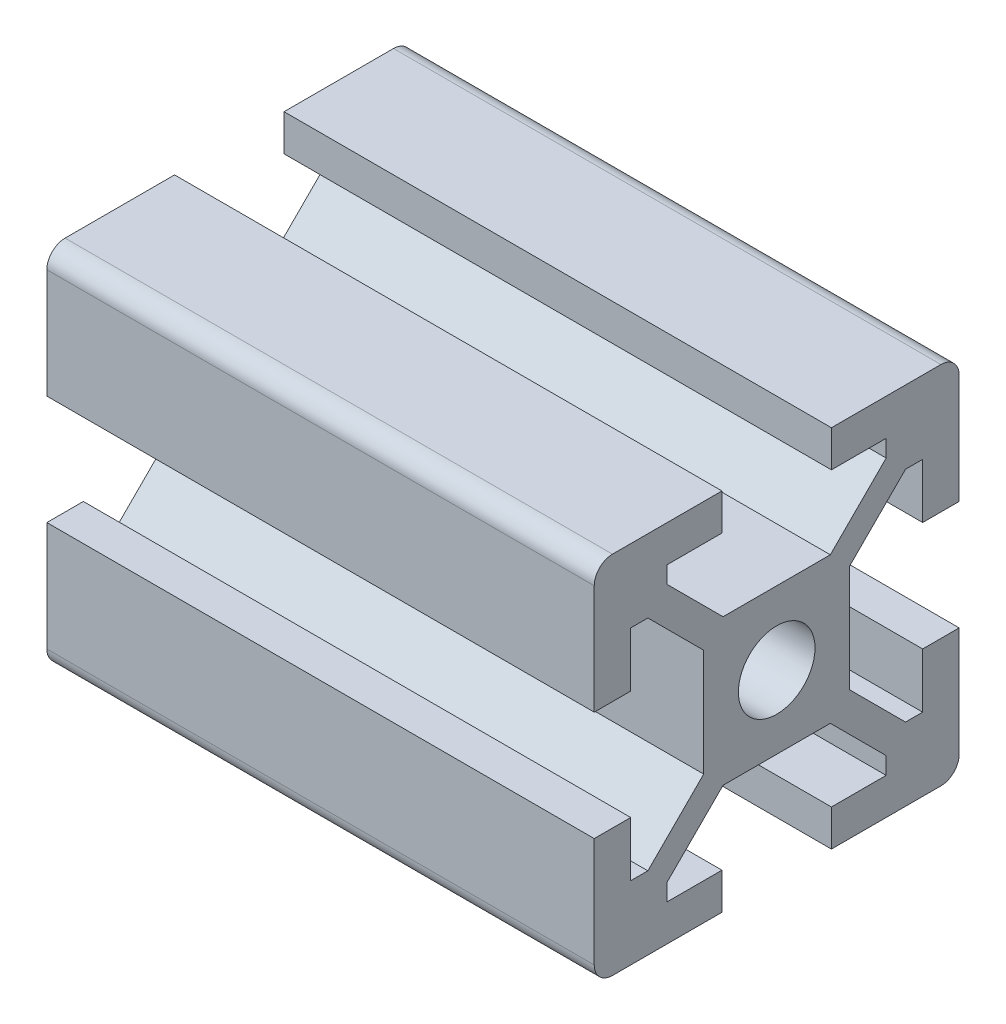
ISO-10303-21;
HEADER;
FILE_DESCRIPTION(('STEP AP214'),'2;1');
FILE_NAME('part.step','',(''),(''),'','','');
FILE_SCHEMA(('AUTOMOTIVE_DESIGN { 1 0 10303 214 1 1 1 1 }'));
ENDSEC;
DATA;
#1=APPLICATION_CONTEXT('core data for automotive mechanical design processes');
#2=APPLICATION_PROTOCOL_DEFINITION('international standard','automotive_design',2000,#1);
#3=PRODUCT_CONTEXT('',#1,'mechanical');
#4=PRODUCT('Part','Part','',(#3));
#5=PRODUCT_RELATED_PRODUCT_CATEGORY('part','',(#4));
#6=PRODUCT_DEFINITION_FORMATION('','',#4);
#7=PRODUCT_DEFINITION_CONTEXT('part definition',#1,'design');
#8=PRODUCT_DEFINITION('design','',#6,#7);
#9=PRODUCT_DEFINITION_SHAPE('','',#8);
#10=(LENGTH_UNIT() NAMED_UNIT(*) SI_UNIT(.MILLI.,.METRE.));
#11=(NAMED_UNIT(*) PLANE_ANGLE_UNIT() SI_UNIT($,.RADIAN.));
#12=(NAMED_UNIT(*) SI_UNIT($,.STERADIAN.) SOLID_ANGLE_UNIT());
#13=UNCERTAINTY_MEASURE_WITH_UNIT(LENGTH_MEASURE(1.E-05),#10,'distance_accuracy_value','');
#14=(GEOMETRIC_REPRESENTATION_CONTEXT(3) GLOBAL_UNCERTAINTY_ASSIGNED_CONTEXT((#13)) GLOBAL_UNIT_ASSIGNED_CONTEXT((#10,
#11,#12)) REPRESENTATION_CONTEXT('',''));
#15=CARTESIAN_POINT('',(0.,0.,0.));
#16=DIRECTION('',(0.,0.,1.));
#17=DIRECTION('',(1.,0.,0.));
#18=AXIS2_PLACEMENT_3D('',#15,#16,#17);
#19=CARTESIAN_POINT('',(30.,9.,9.));
#20=DIRECTION('',(1.,0.,0.));
#21=DIRECTION('',(0.,0.,-1.));
#22=AXIS2_PLACEMENT_3D('',#19,#20,#21);
#23=PLANE('',#22);
#24=CARTESIAN_POINT('',(30.,9.,9.));
#25=DIRECTION('',(1.,0.,0.));
#26=DIRECTION('',(0.,0.,-1.));
#27=AXIS2_PLACEMENT_3D('',#24,#25,#26);
#28=CIRCLE('',#27,1.);
#29=CARTESIAN_POINT('',(30.,10.,9.));
#30=VERTEX_POINT('',#29);
#31=CARTESIAN_POINT('',(30.,9.,10.));
#32=VERTEX_POINT('',#31);
#33=EDGE_CURVE('E471',#30,#32,#28,.T.);
#34=ORIENTED_EDGE('',*,*,#33,.T.);
#35=DIRECTION('',(0.,-1.,0.));
#36=VECTOR('',#35,1.);
#37=CARTESIAN_POINT('',(30.,9.,10.));
#38=LINE('',#37,#36);
#39=CARTESIAN_POINT('',(30.,3.,10.));
#40=VERTEX_POINT('',#39);
#41=EDGE_CURVE('E222',#32,#40,#38,.T.);
#42=ORIENTED_EDGE('',*,*,#41,.T.);
#43=DIRECTION('',(0.,0.,-1.));
#44=VECTOR('',#43,1.);
#45=CARTESIAN_POINT('',(30.,3.,10.));
#46=LINE('',#45,#44);
#47=CARTESIAN_POINT('',(30.,3.,8.));
#48=VERTEX_POINT('',#47);
#49=EDGE_CURVE('E609',#40,#48,#46,.T.);
#50=ORIENTED_EDGE('',*,*,#49,.T.);
#51=DIRECTION('',(0.,1.,0.));
#52=VECTOR('',#51,1.);
#53=CARTESIAN_POINT('',(30.,3.,8.));
#54=LINE('',#53,#52);
#55=CARTESIAN_POINT('',(30.,6.,8.));
#56=VERTEX_POINT('',#55);
#57=EDGE_CURVE('E630',#48,#56,#54,.T.);
#58=ORIENTED_EDGE('',*,*,#57,.T.);
#59=DIRECTION('',(0.,0.,-1.));
#60=VECTOR('',#59,1.);
#61=CARTESIAN_POINT('',(30.,6.,8.));
#62=LINE('',#61,#60);
#63=CARTESIAN_POINT('',(30.,6.,7.06066017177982));
#64=VERTEX_POINT('',#63);
#65=EDGE_CURVE('E624',#56,#64,#62,.T.);
#66=ORIENTED_EDGE('',*,*,#65,.T.);
#67=DIRECTION('',(0.,-0.707106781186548,-0.707106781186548));
#68=VECTOR('',#67,1.);
#69=CARTESIAN_POINT('',(30.,6.,7.06066017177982));
#70=LINE('',#69,#68);
#71=CARTESIAN_POINT('',(30.,2.93933982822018,4.));
#72=VERTEX_POINT('',#71);
#73=EDGE_CURVE('E627',#64,#72,#70,.T.);
#74=ORIENTED_EDGE('',*,*,#73,.T.);
#75=DIRECTION('',(0.,-1.,0.));
#76=VECTOR('',#75,1.);
#77=CARTESIAN_POINT('',(30.,2.93933982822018,4.));
#78=LINE('',#77,#76);
#79=CARTESIAN_POINT('',(30.,-2.93933982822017,4.));
#80=VERTEX_POINT('',#79);
#81=EDGE_CURVE('E626',#72,#80,#78,.T.);
#82=ORIENTED_EDGE('',*,*,#81,.T.);
#83=DIRECTION('',(0.,-0.707106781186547,0.707106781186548));
#84=VECTOR('',#83,1.);
#85=CARTESIAN_POINT('',(30.,-2.93933982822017,4.));
#86=LINE('',#85,#84);
#87=CARTESIAN_POINT('',(30.,-6.,7.06066017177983));
#88=VERTEX_POINT('',#87);
#89=EDGE_CURVE('E631',#80,#88,#86,.T.);
#90=ORIENTED_EDGE('',*,*,#89,.T.);
#91=DIRECTION('',(0.,0.,1.));
#92=VECTOR('',#91,1.);
#93=CARTESIAN_POINT('',(30.,-6.,7.06066017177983));
#94=LINE('',#93,#92);
#95=CARTESIAN_POINT('',(30.,-6.,7.99999999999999));
#96=VERTEX_POINT('',#95);
#97=EDGE_CURVE('E637',#88,#96,#94,.T.);
#98=ORIENTED_EDGE('',*,*,#97,.T.);
#99=DIRECTION('',(0.,1.,0.));
#100=VECTOR('',#99,1.);
#101=CARTESIAN_POINT('',(30.,-6.,7.99999999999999));
#102=LINE('',#101,#100);
#103=CARTESIAN_POINT('',(30.,-3.,7.99999999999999));
#104=VERTEX_POINT('',#103);
#105=EDGE_CURVE('E640',#96,#104,#102,.T.);
#106=ORIENTED_EDGE('',*,*,#105,.T.);
#107=DIRECTION('',(0.,0.,1.));
#108=VECTOR('',#107,1.);
#109=CARTESIAN_POINT('',(30.,-3.,7.99999999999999));
#110=LINE('',#109,#108);
#111=CARTESIAN_POINT('',(30.,-3.,10.));
#112=VERTEX_POINT('',#111);
#113=EDGE_CURVE('E643',#104,#112,#110,.T.);
#114=ORIENTED_EDGE('',*,*,#113,.T.);
#115=DIRECTION('',(0.,-1.,0.));
#116=VECTOR('',#115,1.);
#117=CARTESIAN_POINT('',(30.,-3.,10.));
#118=LINE('',#117,#116);
#119=CARTESIAN_POINT('',(30.,-9.,10.));
#120=VERTEX_POINT('',#119);
#121=EDGE_CURVE('E641',#112,#120,#118,.T.);
#122=ORIENTED_EDGE('',*,*,#121,.T.);
#123=CARTESIAN_POINT('',(30.,-9.,9.));
#124=DIRECTION('',(1.,0.,0.));
#125=DIRECTION('',(0.,0.,-1.));
#126=AXIS2_PLACEMENT_3D('',#123,#124,#125);
#127=CIRCLE('',#126,1.);
#128=CARTESIAN_POINT('',(30.,-10.,9.));
#129=VERTEX_POINT('',#128);
#130=EDGE_CURVE('E642',#120,#129,#127,.T.);
#131=ORIENTED_EDGE('',*,*,#130,.T.);
#132=DIRECTION('',(0.,0.,-1.));
#133=VECTOR('',#132,1.);
#134=CARTESIAN_POINT('',(30.,-10.,9.));
#135=LINE('',#134,#133);
#136=CARTESIAN_POINT('',(30.,-10.,3.));
#137=VERTEX_POINT('',#136);
#138=EDGE_CURVE('E650',#129,#137,#135,.T.);
#139=ORIENTED_EDGE('',*,*,#138,.T.);
#140=DIRECTION('',(0.,1.,0.));
#141=VECTOR('',#140,1.);
#142=CARTESIAN_POINT('',(30.,-10.,3.));
#143=LINE('',#142,#141);
#144=CARTESIAN_POINT('',(30.,-8.,3.));
#145=VERTEX_POINT('',#144);
#146=EDGE_CURVE('E647',#137,#145,#143,.T.);
#147=ORIENTED_EDGE('',*,*,#146,.T.);
#148=DIRECTION('',(0.,0.,1.));
#149=VECTOR('',#148,1.);
#150=CARTESIAN_POINT('',(30.,-8.,3.));
#151=LINE('',#150,#149);
#152=CARTESIAN_POINT('',(30.,-8.,6.));
#153=VERTEX_POINT('',#152);
#154=EDGE_CURVE('E651',#145,#153,#151,.T.);
#155=ORIENTED_EDGE('',*,*,#154,.T.);
#156=DIRECTION('',(0.,1.,0.));
#157=VECTOR('',#156,1.);
#158=CARTESIAN_POINT('',(30.,-8.,6.));
#159=LINE('',#158,#157);
#160=CARTESIAN_POINT('',(30.,-7.06066017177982,6.));
#161=VERTEX_POINT('',#160);
#162=EDGE_CURVE('E653',#153,#161,#159,.T.);
#163=ORIENTED_EDGE('',*,*,#162,.T.);
#164=DIRECTION('',(0.,0.707106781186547,-0.707106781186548));
#165=VECTOR('',#164,1.);
#166=CARTESIAN_POINT('',(30.,-7.06066017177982,6.));
#167=LINE('',#166,#165);
#168=CARTESIAN_POINT('',(30.,-4.,2.93933982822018));
#169=VERTEX_POINT('',#168);
#170=EDGE_CURVE('E654',#161,#169,#167,.T.);
#171=ORIENTED_EDGE('',*,*,#170,.T.);
#172=DIRECTION('',(0.,0.,-1.));
#173=VECTOR('',#172,1.);
#174=CARTESIAN_POINT('',(30.,-4.,2.93933982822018));
#175=LINE('',#174,#173);
#176=CARTESIAN_POINT('',(30.,-4.,-2.93933982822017));
#177=VERTEX_POINT('',#176);
#178=EDGE_CURVE('E660',#169,#177,#175,.T.);
#179=ORIENTED_EDGE('',*,*,#178,.T.);
#180=DIRECTION('',(0.,-0.707106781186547,-0.707106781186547));
#181=VECTOR('',#180,1.);
#182=CARTESIAN_POINT('',(30.,-4.,-2.93933982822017));
#183=LINE('',#182,#181);
#184=CARTESIAN_POINT('',(30.,-7.06066017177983,-6.));
#185=VERTEX_POINT('',#184);
#186=EDGE_CURVE('E658',#177,#185,#183,.T.);
#187=ORIENTED_EDGE('',*,*,#186,.T.);
#188=DIRECTION('',(0.,-1.,0.));
#189=VECTOR('',#188,1.);
#190=CARTESIAN_POINT('',(30.,-7.06066017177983,-6.));
#191=LINE('',#190,#189);
#192=CARTESIAN_POINT('',(30.,-7.99999999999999,-6.));
#193=VERTEX_POINT('',#192);
#194=EDGE_CURVE('E662',#185,#193,#191,.T.);
#195=ORIENTED_EDGE('',*,*,#194,.T.);
#196=DIRECTION('',(0.,0.,1.));
#197=VECTOR('',#196,1.);
#198=CARTESIAN_POINT('',(30.,-7.99999999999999,-6.));
#199=LINE('',#198,#197);
#200=CARTESIAN_POINT('',(30.,-7.99999999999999,-3.));
#201=VERTEX_POINT('',#200);
#202=EDGE_CURVE('E664',#193,#201,#199,.T.);
#203=ORIENTED_EDGE('',*,*,#202,.T.);
#204=DIRECTION('',(0.,-1.,0.));
#205=VECTOR('',#204,1.);
#206=CARTESIAN_POINT('',(30.,-7.99999999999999,-3.));
#207=LINE('',#206,#205);
#208=CARTESIAN_POINT('',(30.,-10.,-3.));
#209=VERTEX_POINT('',#208);
#210=EDGE_CURVE('E663',#201,#209,#207,.T.);
#211=ORIENTED_EDGE('',*,*,#210,.T.);
#212=DIRECTION('',(0.,0.,-1.));
#213=VECTOR('',#212,1.);
#214=CARTESIAN_POINT('',(30.,-10.,-3.));
#215=LINE('',#214,#213);
#216=CARTESIAN_POINT('',(30.,-10.,-9.00000000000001));
#217=VERTEX_POINT('',#216);
#218=EDGE_CURVE('E670',#209,#217,#215,.T.);
#219=ORIENTED_EDGE('',*,*,#218,.T.);
#220=CARTESIAN_POINT('',(30.,-9.,-9.00000000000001));
#221=DIRECTION('',(1.,0.,0.));
#222=DIRECTION('',(0.,0.,-1.));
#223=AXIS2_PLACEMENT_3D('',#220,#221,#222);
#224=CIRCLE('',#223,0.999999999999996);
#225=CARTESIAN_POINT('',(30.,-9.,-10.));
#226=VERTEX_POINT('',#225);
#227=EDGE_CURVE('E666',#217,#226,#224,.T.);
#228=ORIENTED_EDGE('',*,*,#227,.T.);
#229=DIRECTION('',(0.,1.,0.));
#230=VECTOR('',#229,1.);
#231=CARTESIAN_POINT('',(30.,-9.,-10.));
#232=LINE('',#231,#230);
#233=CARTESIAN_POINT('',(30.,-3.,-10.));
#234=VERTEX_POINT('',#233);
#235=EDGE_CURVE('E673',#226,#234,#232,.T.);
#236=ORIENTED_EDGE('',*,*,#235,.T.);
#237=DIRECTION('',(0.,0.,1.));
#238=VECTOR('',#237,1.);
#239=CARTESIAN_POINT('',(30.,-3.,-10.));
#240=LINE('',#239,#238);
#241=CARTESIAN_POINT('',(30.,-3.,-8.00000000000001));
#242=VERTEX_POINT('',#241);
#243=EDGE_CURVE('E672',#234,#242,#240,.T.);
#244=ORIENTED_EDGE('',*,*,#243,.T.);
#245=DIRECTION('',(0.,-1.,0.));
#246=VECTOR('',#245,1.);
#247=CARTESIAN_POINT('',(30.,-3.,-8.00000000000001));
#248=LINE('',#247,#246);
#249=CARTESIAN_POINT('',(30.,-6.,-8.00000000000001));
#250=VERTEX_POINT('',#249);
#251=EDGE_CURVE('E671',#242,#250,#248,.T.);
#252=ORIENTED_EDGE('',*,*,#251,.T.);
#253=DIRECTION('',(0.,0.,1.));
#254=VECTOR('',#253,1.);
#255=CARTESIAN_POINT('',(30.,-6.,-8.00000000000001));
#256=LINE('',#255,#254);
#257=CARTESIAN_POINT('',(30.,-6.,-7.06066017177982));
#258=VERTEX_POINT('',#257);
#259=EDGE_CURVE('E680',#250,#258,#256,.T.);
#260=ORIENTED_EDGE('',*,*,#259,.T.);
#261=DIRECTION('',(0.,0.707106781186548,0.707106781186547));
#262=VECTOR('',#261,1.);
#263=CARTESIAN_POINT('',(30.,-6.,-7.06066017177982));
#264=LINE('',#263,#262);
#265=CARTESIAN_POINT('',(30.,-2.93933982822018,-4.));
#266=VERTEX_POINT('',#265);
#267=EDGE_CURVE('E679',#258,#266,#264,.T.);
#268=ORIENTED_EDGE('',*,*,#267,.T.);
#269=DIRECTION('',(0.,1.,0.));
#270=VECTOR('',#269,1.);
#271=CARTESIAN_POINT('',(30.,-2.93933982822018,-4.));
#272=LINE('',#271,#270);
#273=CARTESIAN_POINT('',(30.,2.93933982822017,-4.));
#274=VERTEX_POINT('',#273);
#275=EDGE_CURVE('E682',#266,#274,#272,.T.);
#276=ORIENTED_EDGE('',*,*,#275,.T.);
#277=DIRECTION('',(0.,0.707106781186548,-0.707106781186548));
#278=VECTOR('',#277,1.);
#279=CARTESIAN_POINT('',(30.,2.93933982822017,-4.));
#280=LINE('',#279,#278);
#281=CARTESIAN_POINT('',(30.,6.,-7.06066017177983));
#282=VERTEX_POINT('',#281);
#283=EDGE_CURVE('E684',#274,#282,#280,.T.);
#284=ORIENTED_EDGE('',*,*,#283,.T.);
#285=DIRECTION('',(0.,0.,-1.));
#286=VECTOR('',#285,1.);
#287=CARTESIAN_POINT('',(30.,6.,-7.06066017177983));
#288=LINE('',#287,#286);
#289=CARTESIAN_POINT('',(30.,6.,-7.99999999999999));
#290=VERTEX_POINT('',#289);
#291=EDGE_CURVE('E683',#282,#290,#288,.T.);
#292=ORIENTED_EDGE('',*,*,#291,.T.);
#293=DIRECTION('',(0.,-1.,0.));
#294=VECTOR('',#293,1.);
#295=CARTESIAN_POINT('',(30.,6.,-7.99999999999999));
#296=LINE('',#295,#294);
#297=CARTESIAN_POINT('',(30.,3.,-7.99999999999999));
#298=VERTEX_POINT('',#297);
#299=EDGE_CURVE('E689',#290,#298,#296,.T.);
#300=ORIENTED_EDGE('',*,*,#299,.T.);
#301=DIRECTION('',(0.,0.,-1.));
#302=VECTOR('',#301,1.);
#303=CARTESIAN_POINT('',(30.,3.,-7.99999999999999));
#304=LINE('',#303,#302);
#305=CARTESIAN_POINT('',(30.,3.,-10.));
#306=VERTEX_POINT('',#305);
#307=EDGE_CURVE('E690',#298,#306,#304,.T.);
#308=ORIENTED_EDGE('',*,*,#307,.T.);
#309=DIRECTION('',(0.,1.,0.));
#310=VECTOR('',#309,1.);
#311=CARTESIAN_POINT('',(30.,3.,-10.));
#312=LINE('',#311,#310);
#313=CARTESIAN_POINT('',(30.,9.,-10.));
#314=VERTEX_POINT('',#313);
#315=EDGE_CURVE('E693',#306,#314,#312,.T.);
#316=ORIENTED_EDGE('',*,*,#315,.T.);
#317=CARTESIAN_POINT('',(30.,9.,-9.00000000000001));
#318=DIRECTION('',(1.,0.,0.));
#319=DIRECTION('',(0.,0.,-1.));
#320=AXIS2_PLACEMENT_3D('',#317,#318,#319);
#321=CIRCLE('',#320,1.);
#322=CARTESIAN_POINT('',(30.,10.,-9.00000000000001));
#323=VERTEX_POINT('',#322);
#324=EDGE_CURVE('E691',#314,#323,#321,.T.);
#325=ORIENTED_EDGE('',*,*,#324,.T.);
#326=DIRECTION('',(0.,0.,1.));
#327=VECTOR('',#326,1.);
#328=CARTESIAN_POINT('',(30.,10.,-9.00000000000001));
#329=LINE('',#328,#327);
#330=CARTESIAN_POINT('',(30.,10.,-3.));
#331=VERTEX_POINT('',#330);
#332=EDGE_CURVE('E694',#323,#331,#329,.T.);
#333=ORIENTED_EDGE('',*,*,#332,.T.);
#334=DIRECTION('',(0.,-1.,0.));
#335=VECTOR('',#334,1.);
#336=CARTESIAN_POINT('',(30.,10.,-3.));
#337=LINE('',#336,#335);
#338=CARTESIAN_POINT('',(30.,8.,-3.));
#339=VERTEX_POINT('',#338);
#340=EDGE_CURVE('E700',#331,#339,#337,.T.);
#341=ORIENTED_EDGE('',*,*,#340,.T.);
#342=DIRECTION('',(0.,0.,-1.));
#343=VECTOR('',#342,1.);
#344=CARTESIAN_POINT('',(30.,8.,-3.));
#345=LINE('',#344,#343);
#346=CARTESIAN_POINT('',(30.,8.,-6.));
#347=VERTEX_POINT('',#346);
#348=EDGE_CURVE('E699',#339,#347,#345,.T.);
#349=ORIENTED_EDGE('',*,*,#348,.T.);
#350=DIRECTION('',(0.,-1.,0.));
#351=VECTOR('',#350,1.);
#352=CARTESIAN_POINT('',(30.,8.,-6.));
#353=LINE('',#352,#351);
#354=CARTESIAN_POINT('',(30.,7.06066017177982,-6.));
#355=VERTEX_POINT('',#354);
#356=EDGE_CURVE('E701',#347,#355,#353,.T.);
#357=ORIENTED_EDGE('',*,*,#356,.T.);
#358=DIRECTION('',(0.,-0.707106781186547,0.707106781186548));
#359=VECTOR('',#358,1.);
#360=CARTESIAN_POINT('',(30.,7.06066017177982,-6.));
#361=LINE('',#360,#359);
#362=CARTESIAN_POINT('',(30.,4.,-2.93933982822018));
#363=VERTEX_POINT('',#362);
#364=EDGE_CURVE('E703',#355,#363,#361,.T.);
#365=ORIENTED_EDGE('',*,*,#364,.T.);
#366=DIRECTION('',(0.,0.,1.));
#367=VECTOR('',#366,1.);
#368=CARTESIAN_POINT('',(30.,4.,-2.93933982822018));
#369=LINE('',#368,#367);
#370=CARTESIAN_POINT('',(30.,4.,2.93933982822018));
#371=VERTEX_POINT('',#370);
#372=EDGE_CURVE('E704',#363,#371,#369,.T.);
#373=ORIENTED_EDGE('',*,*,#372,.T.);
#374=DIRECTION('',(0.,0.707106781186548,0.707106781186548));
#375=VECTOR('',#374,1.);
#376=CARTESIAN_POINT('',(30.,4.,2.93933982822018));
#377=LINE('',#376,#375);
#378=CARTESIAN_POINT('',(30.,7.06066017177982,6.));
#379=VERTEX_POINT('',#378);
#380=EDGE_CURVE('E710',#371,#379,#377,.T.);
#381=ORIENTED_EDGE('',*,*,#380,.T.);
#382=DIRECTION('',(0.,1.,0.));
#383=VECTOR('',#382,1.);
#384=CARTESIAN_POINT('',(30.,7.06066017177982,6.));
#385=LINE('',#384,#383);
#386=CARTESIAN_POINT('',(30.,7.99999999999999,6.));
#387=VERTEX_POINT('',#386);
#388=EDGE_CURVE('E356',#379,#387,#385,.T.);
#389=ORIENTED_EDGE('',*,*,#388,.T.);
#390=DIRECTION('',(0.,0.,-1.));
#391=VECTOR('',#390,1.);
#392=CARTESIAN_POINT('',(30.,7.99999999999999,6.));
#393=LINE('',#392,#391);
#394=CARTESIAN_POINT('',(30.,7.99999999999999,3.));
#395=VERTEX_POINT('',#394);
#396=EDGE_CURVE('E351',#387,#395,#393,.T.);
#397=ORIENTED_EDGE('',*,*,#396,.T.);
#398=DIRECTION('',(0.,1.,0.));
#399=VECTOR('',#398,1.);
#400=CARTESIAN_POINT('',(30.,7.99999999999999,3.));
#401=LINE('',#400,#399);
#402=CARTESIAN_POINT('',(30.,10.,3.));
#403=VERTEX_POINT('',#402);
#404=EDGE_CURVE('E357',#395,#403,#401,.T.);
#405=ORIENTED_EDGE('',*,*,#404,.T.);
#406=DIRECTION('',(0.,0.,1.));
#407=VECTOR('',#406,1.);
#408=CARTESIAN_POINT('',(30.,10.,3.));
#409=LINE('',#408,#407);
#410=EDGE_CURVE('E59',#403,#30,#409,.T.);
#411=ORIENTED_EDGE('',*,*,#410,.T.);
#412=EDGE_LOOP('',(#34,#42,#50,#58,#66,#74,#82,#90,#98,#106,#114,#122,#131,#139,#147,#155,#163,
#171,#179,#187,#195,#203,#211,#219,#228,#236,#244,#252,#260,#268,#276,#284,#292,#300,#308,#316,
#325,#333,#341,#349,#357,#365,#373,#381,#389,#397,#405,#411));
#413=FACE_BOUND('',#412,.T.);
#414=CARTESIAN_POINT('',(30.,0.,0.));
#415=DIRECTION('',(1.,0.,0.));
#416=DIRECTION('',(0.,0.,-1.));
#417=AXIS2_PLACEMENT_3D('',#414,#415,#416);
#418=CIRCLE('',#417,2.1);
#419=CARTESIAN_POINT('',(30.,0.,-2.1));
#420=VERTEX_POINT('',#419);
#421=EDGE_CURVE('E385',#420,#420,#418,.T.);
#422=ORIENTED_EDGE('',*,*,#421,.F.);
#423=EDGE_LOOP('',(#422));
#424=FACE_BOUND('',#423,.T.);
#425=ADVANCED_FACE('F41',(#413,#424),#23,.T.);
#426=CARTESIAN_POINT('',(0.,9.,9.));
#427=DIRECTION('',(1.,0.,0.));
#428=DIRECTION('',(0.,0.,-1.));
#429=AXIS2_PLACEMENT_3D('',#426,#427,#428);
#430=PLANE('',#429);
#431=CARTESIAN_POINT('',(0.,9.,9.));
#432=DIRECTION('',(1.,0.,0.));
#433=DIRECTION('',(0.,0.,-1.));
#434=AXIS2_PLACEMENT_3D('',#431,#432,#433);
#435=CIRCLE('',#434,1.);
#436=CARTESIAN_POINT('',(0.,10.,9.));
#437=VERTEX_POINT('',#436);
#438=CARTESIAN_POINT('',(0.,9.,10.));
#439=VERTEX_POINT('',#438);
#440=EDGE_CURVE('E378',#437,#439,#435,.T.);
#441=ORIENTED_EDGE('',*,*,#440,.F.);
#442=DIRECTION('',(0.,0.,1.));
#443=VECTOR('',#442,1.);
#444=CARTESIAN_POINT('',(0.,10.,3.));
#445=LINE('',#444,#443);
#446=CARTESIAN_POINT('',(0.,10.,3.));
#447=VERTEX_POINT('',#446);
#448=EDGE_CURVE('E213',#447,#437,#445,.T.);
#449=ORIENTED_EDGE('',*,*,#448,.F.);
#450=DIRECTION('',(0.,1.,0.));
#451=VECTOR('',#450,1.);
#452=CARTESIAN_POINT('',(0.,7.99999999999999,3.));
#453=LINE('',#452,#451);
#454=CARTESIAN_POINT('',(0.,7.99999999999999,3.));
#455=VERTEX_POINT('',#454);
#456=EDGE_CURVE('E210',#455,#447,#453,.T.);
#457=ORIENTED_EDGE('',*,*,#456,.F.);
#458=DIRECTION('',(0.,0.,-1.));
#459=VECTOR('',#458,1.);
#460=CARTESIAN_POINT('',(0.,7.99999999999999,6.));
#461=LINE('',#460,#459);
#462=CARTESIAN_POINT('',(0.,7.99999999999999,6.));
#463=VERTEX_POINT('',#462);
#464=EDGE_CURVE('E366',#463,#455,#461,.T.);
#465=ORIENTED_EDGE('',*,*,#464,.F.);
#466=DIRECTION('',(0.,1.,0.));
#467=VECTOR('',#466,1.);
#468=CARTESIAN_POINT('',(0.,7.06066017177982,6.));
#469=LINE('',#468,#467);
#470=CARTESIAN_POINT('',(0.,7.06066017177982,6.));
#471=VERTEX_POINT('',#470);
#472=EDGE_CURVE('E467',#471,#463,#469,.T.);
#473=ORIENTED_EDGE('',*,*,#472,.F.);
#474=DIRECTION('',(0.,0.707106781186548,0.707106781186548));
#475=VECTOR('',#474,1.);
#476=CARTESIAN_POINT('',(0.,4.,2.93933982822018));
#477=LINE('',#476,#475);
#478=CARTESIAN_POINT('',(0.,4.,2.93933982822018));
#479=VERTEX_POINT('',#478);
#480=EDGE_CURVE('E468',#479,#471,#477,.T.);
#481=ORIENTED_EDGE('',*,*,#480,.F.);
#482=DIRECTION('',(0.,0.,1.));
#483=VECTOR('',#482,1.);
#484=CARTESIAN_POINT('',(0.,4.,-2.93933982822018));
#485=LINE('',#484,#483);
#486=CARTESIAN_POINT('',(0.,4.,-2.93933982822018));
#487=VERTEX_POINT('',#486);
#488=EDGE_CURVE('E461',#487,#479,#485,.T.);
#489=ORIENTED_EDGE('',*,*,#488,.F.);
#490=DIRECTION('',(0.,-0.707106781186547,0.707106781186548));
#491=VECTOR('',#490,1.);
#492=CARTESIAN_POINT('',(0.,7.06066017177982,-6.));
#493=LINE('',#492,#491);
#494=CARTESIAN_POINT('',(0.,7.06066017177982,-6.));
#495=VERTEX_POINT('',#494);
#496=EDGE_CURVE('E465',#495,#487,#493,.T.);
#497=ORIENTED_EDGE('',*,*,#496,.F.);
#498=DIRECTION('',(0.,-1.,0.));
#499=VECTOR('',#498,1.);
#500=CARTESIAN_POINT('',(0.,8.,-6.));
#501=LINE('',#500,#499);
#502=CARTESIAN_POINT('',(0.,8.,-6.));
#503=VERTEX_POINT('',#502);
#504=EDGE_CURVE('E458',#503,#495,#501,.T.);
#505=ORIENTED_EDGE('',*,*,#504,.F.);
#506=DIRECTION('',(0.,0.,-1.));
#507=VECTOR('',#506,1.);
#508=CARTESIAN_POINT('',(0.,8.,-3.));
#509=LINE('',#508,#507);
#510=CARTESIAN_POINT('',(0.,8.,-3.));
#511=VERTEX_POINT('',#510);
#512=EDGE_CURVE('E456',#511,#503,#509,.T.);
#513=ORIENTED_EDGE('',*,*,#512,.F.);
#514=DIRECTION('',(0.,-1.,0.));
#515=VECTOR('',#514,1.);
#516=CARTESIAN_POINT('',(0.,10.,-3.));
#517=LINE('',#516,#515);
#518=CARTESIAN_POINT('',(0.,10.,-3.));
#519=VERTEX_POINT('',#518);
#520=EDGE_CURVE('E457',#519,#511,#517,.T.);
#521=ORIENTED_EDGE('',*,*,#520,.F.);
#522=DIRECTION('',(0.,0.,1.));
#523=VECTOR('',#522,1.);
#524=CARTESIAN_POINT('',(0.,10.,-9.00000000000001));
#525=LINE('',#524,#523);
#526=CARTESIAN_POINT('',(0.,10.,-9.00000000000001));
#527=VERTEX_POINT('',#526);
#528=EDGE_CURVE('E455',#527,#519,#525,.T.);
#529=ORIENTED_EDGE('',*,*,#528,.F.);
#530=CARTESIAN_POINT('',(0.,9.,-9.00000000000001));
#531=DIRECTION('',(1.,0.,0.));
#532=DIRECTION('',(0.,0.,-1.));
#533=AXIS2_PLACEMENT_3D('',#530,#531,#532);
#534=CIRCLE('',#533,1.);
#535=CARTESIAN_POINT('',(0.,9.,-10.));
#536=VERTEX_POINT('',#535);
#537=EDGE_CURVE('E454',#536,#527,#534,.T.);
#538=ORIENTED_EDGE('',*,*,#537,.F.);
#539=DIRECTION('',(0.,1.,0.));
#540=VECTOR('',#539,1.);
#541=CARTESIAN_POINT('',(0.,3.,-10.));
#542=LINE('',#541,#540);
#543=CARTESIAN_POINT('',(0.,3.,-10.));
#544=VERTEX_POINT('',#543);
#545=EDGE_CURVE('E448',#544,#536,#542,.T.);
#546=ORIENTED_EDGE('',*,*,#545,.F.);
#547=DIRECTION('',(0.,0.,-1.));
#548=VECTOR('',#547,1.);
#549=CARTESIAN_POINT('',(0.,3.,-7.99999999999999));
#550=LINE('',#549,#548);
#551=CARTESIAN_POINT('',(0.,3.,-7.99999999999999));
#552=VERTEX_POINT('',#551);
#553=EDGE_CURVE('E449',#552,#544,#550,.T.);
#554=ORIENTED_EDGE('',*,*,#553,.F.);
#555=DIRECTION('',(0.,-1.,0.));
#556=VECTOR('',#555,1.);
#557=CARTESIAN_POINT('',(0.,6.,-7.99999999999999));
#558=LINE('',#557,#556);
#559=CARTESIAN_POINT('',(0.,6.,-7.99999999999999));
#560=VERTEX_POINT('',#559);
#561=EDGE_CURVE('E447',#560,#552,#558,.T.);
#562=ORIENTED_EDGE('',*,*,#561,.F.);
#563=DIRECTION('',(0.,0.,-1.));
#564=VECTOR('',#563,1.);
#565=CARTESIAN_POINT('',(0.,6.,-7.06066017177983));
#566=LINE('',#565,#564);
#567=CARTESIAN_POINT('',(0.,6.,-7.06066017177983));
#568=VERTEX_POINT('',#567);
#569=EDGE_CURVE('E441',#568,#560,#566,.T.);
#570=ORIENTED_EDGE('',*,*,#569,.F.);
#571=DIRECTION('',(0.,0.707106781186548,-0.707106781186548));
#572=VECTOR('',#571,1.);
#573=CARTESIAN_POINT('',(0.,2.93933982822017,-4.));
#574=LINE('',#573,#572);
#575=CARTESIAN_POINT('',(0.,2.93933982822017,-4.));
#576=VERTEX_POINT('',#575);
#577=EDGE_CURVE('E445',#576,#568,#574,.T.);
#578=ORIENTED_EDGE('',*,*,#577,.F.);
#579=DIRECTION('',(0.,1.,0.));
#580=VECTOR('',#579,1.);
#581=CARTESIAN_POINT('',(0.,-2.93933982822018,-4.));
#582=LINE('',#581,#580);
#583=CARTESIAN_POINT('',(0.,-2.93933982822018,-4.));
#584=VERTEX_POINT('',#583);
#585=EDGE_CURVE('E439',#584,#576,#582,.T.);
#586=ORIENTED_EDGE('',*,*,#585,.F.);
#587=DIRECTION('',(0.,0.707106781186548,0.707106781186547));
#588=VECTOR('',#587,1.);
#589=CARTESIAN_POINT('',(0.,-6.,-7.06066017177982));
#590=LINE('',#589,#588);
#591=CARTESIAN_POINT('',(0.,-6.,-7.06066017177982));
#592=VERTEX_POINT('',#591);
#593=EDGE_CURVE('E437',#592,#584,#590,.T.);
#594=ORIENTED_EDGE('',*,*,#593,.F.);
#595=DIRECTION('',(0.,0.,1.));
#596=VECTOR('',#595,1.);
#597=CARTESIAN_POINT('',(0.,-6.,-8.00000000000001));
#598=LINE('',#597,#596);
#599=CARTESIAN_POINT('',(0.,-6.,-8.00000000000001));
#600=VERTEX_POINT('',#599);
#601=EDGE_CURVE('E436',#600,#592,#598,.T.);
#602=ORIENTED_EDGE('',*,*,#601,.F.);
#603=DIRECTION('',(0.,-1.,0.));
#604=VECTOR('',#603,1.);
#605=CARTESIAN_POINT('',(0.,-3.,-8.00000000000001));
#606=LINE('',#605,#604);
#607=CARTESIAN_POINT('',(0.,-3.,-8.00000000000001));
#608=VERTEX_POINT('',#607);
#609=EDGE_CURVE('E432',#608,#600,#606,.T.);
#610=ORIENTED_EDGE('',*,*,#609,.F.);
#611=DIRECTION('',(0.,0.,1.));
#612=VECTOR('',#611,1.);
#613=CARTESIAN_POINT('',(0.,-3.,-10.));
#614=LINE('',#613,#612);
#615=CARTESIAN_POINT('',(0.,-3.,-10.));
#616=VERTEX_POINT('',#615);
#617=EDGE_CURVE('E435',#616,#608,#614,.T.);
#618=ORIENTED_EDGE('',*,*,#617,.F.);
#619=DIRECTION('',(0.,1.,0.));
#620=VECTOR('',#619,1.);
#621=CARTESIAN_POINT('',(0.,-9.,-10.));
#622=LINE('',#621,#620);
#623=CARTESIAN_POINT('',(0.,-9.,-10.));
#624=VERTEX_POINT('',#623);
#625=EDGE_CURVE('E429',#624,#616,#622,.T.);
#626=ORIENTED_EDGE('',*,*,#625,.F.);
#627=CARTESIAN_POINT('',(0.,-9.,-9.00000000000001));
#628=DIRECTION('',(1.,0.,0.));
#629=DIRECTION('',(0.,0.,-1.));
#630=AXIS2_PLACEMENT_3D('',#627,#628,#629);
#631=CIRCLE('',#630,0.999999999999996);
#632=CARTESIAN_POINT('',(0.,-10.,-9.00000000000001));
#633=VERTEX_POINT('',#632);
#634=EDGE_CURVE('E428',#633,#624,#631,.T.);
#635=ORIENTED_EDGE('',*,*,#634,.F.);
#636=DIRECTION('',(0.,0.,-1.));
#637=VECTOR('',#636,1.);
#638=CARTESIAN_POINT('',(0.,-10.,-3.));
#639=LINE('',#638,#637);
#640=CARTESIAN_POINT('',(0.,-10.,-3.));
#641=VERTEX_POINT('',#640);
#642=EDGE_CURVE('E426',#641,#633,#639,.T.);
#643=ORIENTED_EDGE('',*,*,#642,.F.);
#644=DIRECTION('',(0.,-1.,0.));
#645=VECTOR('',#644,1.);
#646=CARTESIAN_POINT('',(0.,-7.99999999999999,-3.));
#647=LINE('',#646,#645);
#648=CARTESIAN_POINT('',(0.,-7.99999999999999,-3.));
#649=VERTEX_POINT('',#648);
#650=EDGE_CURVE('E424',#649,#641,#647,.T.);
#651=ORIENTED_EDGE('',*,*,#650,.F.);
#652=DIRECTION('',(0.,0.,1.));
#653=VECTOR('',#652,1.);
#654=CARTESIAN_POINT('',(0.,-7.99999999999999,-6.));
#655=LINE('',#654,#653);
#656=CARTESIAN_POINT('',(0.,-7.99999999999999,-6.));
#657=VERTEX_POINT('',#656);
#658=EDGE_CURVE('E425',#657,#649,#655,.T.);
#659=ORIENTED_EDGE('',*,*,#658,.F.);
#660=DIRECTION('',(0.,-1.,0.));
#661=VECTOR('',#660,1.);
#662=CARTESIAN_POINT('',(0.,-7.06066017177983,-6.));
#663=LINE('',#662,#661);
#664=CARTESIAN_POINT('',(0.,-7.06066017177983,-6.));
#665=VERTEX_POINT('',#664);
#666=EDGE_CURVE('E419',#665,#657,#663,.T.);
#667=ORIENTED_EDGE('',*,*,#666,.F.);
#668=DIRECTION('',(0.,-0.707106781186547,-0.707106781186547));
#669=VECTOR('',#668,1.);
#670=CARTESIAN_POINT('',(0.,-4.,-2.93933982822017));
#671=LINE('',#670,#669);
#672=CARTESIAN_POINT('',(0.,-4.,-2.93933982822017));
#673=VERTEX_POINT('',#672);
#674=EDGE_CURVE('E416',#673,#665,#671,.T.);
#675=ORIENTED_EDGE('',*,*,#674,.F.);
#676=DIRECTION('',(0.,0.,-1.));
#677=VECTOR('',#676,1.);
#678=CARTESIAN_POINT('',(0.,-4.,2.93933982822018));
#679=LINE('',#678,#677);
#680=CARTESIAN_POINT('',(0.,-4.,2.93933982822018));
#681=VERTEX_POINT('',#680);
#682=EDGE_CURVE('E418',#681,#673,#679,.T.);
#683=ORIENTED_EDGE('',*,*,#682,.F.);
#684=DIRECTION('',(0.,0.707106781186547,-0.707106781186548));
#685=VECTOR('',#684,1.);
#686=CARTESIAN_POINT('',(0.,-7.06066017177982,6.));
#687=LINE('',#686,#685);
#688=CARTESIAN_POINT('',(0.,-7.06066017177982,6.));
#689=VERTEX_POINT('',#688);
#690=EDGE_CURVE('E415',#689,#681,#687,.T.);
#691=ORIENTED_EDGE('',*,*,#690,.F.);
#692=DIRECTION('',(0.,1.,0.));
#693=VECTOR('',#692,1.);
#694=CARTESIAN_POINT('',(0.,-8.,6.));
#695=LINE('',#694,#693);
#696=CARTESIAN_POINT('',(0.,-8.,6.));
#697=VERTEX_POINT('',#696);
#698=EDGE_CURVE('E414',#697,#689,#695,.T.);
#699=ORIENTED_EDGE('',*,*,#698,.F.);
#700=DIRECTION('',(0.,0.,1.));
#701=VECTOR('',#700,1.);
#702=CARTESIAN_POINT('',(0.,-8.,3.));
#703=LINE('',#702,#701);
#704=CARTESIAN_POINT('',(0.,-8.,3.));
#705=VERTEX_POINT('',#704);
#706=EDGE_CURVE('E408',#705,#697,#703,.T.);
#707=ORIENTED_EDGE('',*,*,#706,.F.);
#708=DIRECTION('',(0.,1.,0.));
#709=VECTOR('',#708,1.);
#710=CARTESIAN_POINT('',(0.,-10.,3.));
#711=LINE('',#710,#709);
#712=CARTESIAN_POINT('',(0.,-10.,3.));
#713=VERTEX_POINT('',#712);
#714=EDGE_CURVE('E409',#713,#705,#711,.T.);
#715=ORIENTED_EDGE('',*,*,#714,.F.);
#716=DIRECTION('',(0.,0.,-1.));
#717=VECTOR('',#716,1.);
#718=CARTESIAN_POINT('',(0.,-10.,9.));
#719=LINE('',#718,#717);
#720=CARTESIAN_POINT('',(0.,-10.,9.));
#721=VERTEX_POINT('',#720);
#722=EDGE_CURVE('E407',#721,#713,#719,.T.);
#723=ORIENTED_EDGE('',*,*,#722,.F.);
#724=CARTESIAN_POINT('',(0.,-9.,9.));
#725=DIRECTION('',(1.,0.,0.));
#726=DIRECTION('',(0.,0.,-1.));
#727=AXIS2_PLACEMENT_3D('',#724,#725,#726);
#728=CIRCLE('',#727,1.);
#729=CARTESIAN_POINT('',(0.,-9.,10.));
#730=VERTEX_POINT('',#729);
#731=EDGE_CURVE('E404',#730,#721,#728,.T.);
#732=ORIENTED_EDGE('',*,*,#731,.F.);
#733=DIRECTION('',(0.,-1.,0.));
#734=VECTOR('',#733,1.);
#735=CARTESIAN_POINT('',(0.,-3.,10.));
#736=LINE('',#735,#734);
#737=CARTESIAN_POINT('',(0.,-3.,10.));
#738=VERTEX_POINT('',#737);
#739=EDGE_CURVE('E405',#738,#730,#736,.T.);
#740=ORIENTED_EDGE('',*,*,#739,.F.);
#741=DIRECTION('',(0.,0.,1.));
#742=VECTOR('',#741,1.);
#743=CARTESIAN_POINT('',(0.,-3.,7.99999999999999));
#744=LINE('',#743,#742);
#745=CARTESIAN_POINT('',(0.,-3.,7.99999999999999));
#746=VERTEX_POINT('',#745);
#747=EDGE_CURVE('E396',#746,#738,#744,.T.);
#748=ORIENTED_EDGE('',*,*,#747,.F.);
#749=DIRECTION('',(0.,1.,0.));
#750=VECTOR('',#749,1.);
#751=CARTESIAN_POINT('',(0.,-6.,7.99999999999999));
#752=LINE('',#751,#750);
#753=CARTESIAN_POINT('',(0.,-6.,7.99999999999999));
#754=VERTEX_POINT('',#753);
#755=EDGE_CURVE('E397',#754,#746,#752,.T.);
#756=ORIENTED_EDGE('',*,*,#755,.F.);
#757=DIRECTION('',(0.,0.,1.));
#758=VECTOR('',#757,1.);
#759=CARTESIAN_POINT('',(0.,-6.,7.06066017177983));
#760=LINE('',#759,#758);
#761=CARTESIAN_POINT('',(0.,-6.,7.06066017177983));
#762=VERTEX_POINT('',#761);
#763=EDGE_CURVE('E398',#762,#754,#760,.T.);
#764=ORIENTED_EDGE('',*,*,#763,.F.);
#765=DIRECTION('',(0.,-0.707106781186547,0.707106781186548));
#766=VECTOR('',#765,1.);
#767=CARTESIAN_POINT('',(0.,-2.93933982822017,4.));
#768=LINE('',#767,#766);
#769=CARTESIAN_POINT('',(0.,-2.93933982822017,4.));
#770=VERTEX_POINT('',#769);
#771=EDGE_CURVE('E391',#770,#762,#768,.T.);
#772=ORIENTED_EDGE('',*,*,#771,.F.);
#773=DIRECTION('',(0.,-1.,0.));
#774=VECTOR('',#773,1.);
#775=CARTESIAN_POINT('',(0.,2.93933982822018,4.));
#776=LINE('',#775,#774);
#777=CARTESIAN_POINT('',(0.,2.93933982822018,4.));
#778=VERTEX_POINT('',#777);
#779=EDGE_CURVE('E395',#778,#770,#776,.T.);
#780=ORIENTED_EDGE('',*,*,#779,.F.);
#781=DIRECTION('',(0.,-0.707106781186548,-0.707106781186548));
#782=VECTOR('',#781,1.);
#783=CARTESIAN_POINT('',(0.,6.,7.06066017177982));
#784=LINE('',#783,#782);
#785=CARTESIAN_POINT('',(0.,6.,7.06066017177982));
#786=VERTEX_POINT('',#785);
#787=EDGE_CURVE('E388',#786,#778,#784,.T.);
#788=ORIENTED_EDGE('',*,*,#787,.F.);
#789=DIRECTION('',(0.,0.,-1.));
#790=VECTOR('',#789,1.);
#791=CARTESIAN_POINT('',(0.,6.,8.));
#792=LINE('',#791,#790);
#793=CARTESIAN_POINT('',(0.,6.,8.));
#794=VERTEX_POINT('',#793);
#795=EDGE_CURVE('E389',#794,#786,#792,.T.);
#796=ORIENTED_EDGE('',*,*,#795,.F.);
#797=DIRECTION('',(0.,1.,0.));
#798=VECTOR('',#797,1.);
#799=CARTESIAN_POINT('',(0.,3.,8.));
#800=LINE('',#799,#798);
#801=CARTESIAN_POINT('',(0.,3.,8.));
#802=VERTEX_POINT('',#801);
#803=EDGE_CURVE('E387',#802,#794,#800,.T.);
#804=ORIENTED_EDGE('',*,*,#803,.F.);
#805=DIRECTION('',(0.,0.,-1.));
#806=VECTOR('',#805,1.);
#807=CARTESIAN_POINT('',(0.,3.,10.));
#808=LINE('',#807,#806);
#809=CARTESIAN_POINT('',(0.,3.,10.));
#810=VERTEX_POINT('',#809);
#811=EDGE_CURVE('E383',#810,#802,#808,.T.);
#812=ORIENTED_EDGE('',*,*,#811,.F.);
#813=DIRECTION('',(0.,-1.,0.));
#814=VECTOR('',#813,1.);
#815=CARTESIAN_POINT('',(0.,9.,10.));
#816=LINE('',#815,#814);
#817=EDGE_CURVE('E381',#439,#810,#816,.T.);
#818=ORIENTED_EDGE('',*,*,#817,.F.);
#819=EDGE_LOOP('',(#441,#449,#457,#465,#473,#481,#489,#497,#505,#513,#521,#529,#538,#546,#554,
#562,#570,#578,#586,#594,#602,#610,#618,#626,#635,#643,#651,#659,#667,#675,#683,#691,#699,#707,
#715,#723,#732,#740,#748,#756,#764,#772,#780,#788,#796,#804,#812,#818));
#820=FACE_BOUND('',#819,.T.);
#821=CARTESIAN_POINT('',(0.,0.,0.));
#822=DIRECTION('',(1.,0.,0.));
#823=DIRECTION('',(0.,0.,-1.));
#824=AXIS2_PLACEMENT_3D('',#821,#822,#823);
#825=CIRCLE('',#824,2.1);
#826=CARTESIAN_POINT('',(0.,0.,-2.1));
#827=VERTEX_POINT('',#826);
#828=EDGE_CURVE('E1338',#827,#827,#825,.T.);
#829=ORIENTED_EDGE('',*,*,#828,.T.);
#830=EDGE_LOOP('',(#829));
#831=FACE_BOUND('',#830,.T.);
#832=ADVANCED_FACE('F615',(#820,#831),#430,.F.);
#833=CARTESIAN_POINT('',(30.,9.,9.));
#834=DIRECTION('',(-1.,0.,0.));
#835=DIRECTION('',(0.,0.,1.));
#836=AXIS2_PLACEMENT_3D('',#833,#834,#835);
#837=CYLINDRICAL_SURFACE('',#836,1.);
#838=ORIENTED_EDGE('',*,*,#440,.T.);
#839=DIRECTION('',(-1.,0.,0.));
#840=VECTOR('',#839,1.);
#841=CARTESIAN_POINT('',(30.,9.,10.));
#842=LINE('',#841,#840);
#843=EDGE_CURVE('E11',#32,#439,#842,.T.);
#844=ORIENTED_EDGE('',*,*,#843,.F.);
#845=ORIENTED_EDGE('',*,*,#33,.F.);
#846=DIRECTION('',(-1.,0.,0.));
#847=VECTOR('',#846,1.);
#848=CARTESIAN_POINT('',(30.,10.,9.));
#849=LINE('',#848,#847);
#850=EDGE_CURVE('E372',#30,#437,#849,.T.);
#851=ORIENTED_EDGE('',*,*,#850,.T.);
#852=EDGE_LOOP('',(#838,#844,#845,#851));
#853=FACE_BOUND('',#852,.T.);
#854=ADVANCED_FACE('F43',(#853),#837,.T.);
#855=CARTESIAN_POINT('',(30.,9.,10.));
#856=DIRECTION('',(0.,0.,-1.));
#857=DIRECTION('',(-1.,0.,0.));
#858=AXIS2_PLACEMENT_3D('',#855,#856,#857);
#859=PLANE('',#858);
#860=ORIENTED_EDGE('',*,*,#817,.T.);
#861=DIRECTION('',(-1.,0.,0.));
#862=VECTOR('',#861,1.);
#863=CARTESIAN_POINT('',(30.,3.,10.));
#864=LINE('',#863,#862);
#865=EDGE_CURVE('E49',#40,#810,#864,.T.);
#866=ORIENTED_EDGE('',*,*,#865,.F.);
#867=ORIENTED_EDGE('',*,*,#41,.F.);
#868=ORIENTED_EDGE('',*,*,#843,.T.);
#869=EDGE_LOOP('',(#860,#866,#867,#868));
#870=FACE_BOUND('',#869,.T.);
#871=ADVANCED_FACE('F744',(#870),#859,.F.);
#872=CARTESIAN_POINT('',(30.,3.,10.));
#873=DIRECTION('',(0.,1.,0.));
#874=DIRECTION('',(0.,0.,1.));
#875=AXIS2_PLACEMENT_3D('',#872,#873,#874);
#876=PLANE('',#875);
#877=ORIENTED_EDGE('',*,*,#811,.T.);
#878=DIRECTION('',(-1.,0.,0.));
#879=VECTOR('',#878,1.);
#880=CARTESIAN_POINT('',(30.,3.,8.));
#881=LINE('',#880,#879);
#882=EDGE_CURVE('E599',#48,#802,#881,.T.);
#883=ORIENTED_EDGE('',*,*,#882,.F.);
#884=ORIENTED_EDGE('',*,*,#49,.F.);
#885=ORIENTED_EDGE('',*,*,#865,.T.);
#886=EDGE_LOOP('',(#877,#883,#884,#885));
#887=FACE_BOUND('',#886,.T.);
#888=ADVANCED_FACE('F607',(#887),#876,.F.);
#889=CARTESIAN_POINT('',(30.,3.,8.));
#890=DIRECTION('',(0.,0.,1.));
#891=DIRECTION('',(1.,0.,0.));
#892=AXIS2_PLACEMENT_3D('',#889,#890,#891);
#893=PLANE('',#892);
#894=ORIENTED_EDGE('',*,*,#803,.T.);
#895=DIRECTION('',(-1.,0.,0.));
#896=VECTOR('',#895,1.);
#897=CARTESIAN_POINT('',(30.,6.,8.));
#898=LINE('',#897,#896);
#899=EDGE_CURVE('E600',#56,#794,#898,.T.);
#900=ORIENTED_EDGE('',*,*,#899,.F.);
#901=ORIENTED_EDGE('',*,*,#57,.F.);
#902=ORIENTED_EDGE('',*,*,#882,.T.);
#903=EDGE_LOOP('',(#894,#900,#901,#902));
#904=FACE_BOUND('',#903,.T.);
#905=ADVANCED_FACE('F617',(#904),#893,.F.);
#906=CARTESIAN_POINT('',(30.,6.,8.));
#907=DIRECTION('',(0.,1.,0.));
#908=DIRECTION('',(0.,0.,1.));
#909=AXIS2_PLACEMENT_3D('',#906,#907,#908);
#910=PLANE('',#909);
#911=ORIENTED_EDGE('',*,*,#795,.T.);
#912=DIRECTION('',(-1.,0.,0.));
#913=VECTOR('',#912,1.);
#914=CARTESIAN_POINT('',(30.,6.,7.06066017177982));
#915=LINE('',#914,#913);
#916=EDGE_CURVE('E592',#64,#786,#915,.T.);
#917=ORIENTED_EDGE('',*,*,#916,.F.);
#918=ORIENTED_EDGE('',*,*,#65,.F.);
#919=ORIENTED_EDGE('',*,*,#899,.T.);
#920=EDGE_LOOP('',(#911,#917,#918,#919));
#921=FACE_BOUND('',#920,.T.);
#922=ADVANCED_FACE('F625',(#921),#910,.F.);
#923=CARTESIAN_POINT('',(30.,6.,7.06066017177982));
#924=DIRECTION('',(0.,0.707106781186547,-0.707106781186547));
#925=DIRECTION('',(0.,0.707106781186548,0.707106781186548));
#926=AXIS2_PLACEMENT_3D('',#923,#924,#925);
#927=PLANE('',#926);
#928=ORIENTED_EDGE('',*,*,#787,.T.);
#929=DIRECTION('',(-1.,0.,0.));
#930=VECTOR('',#929,1.);
#931=CARTESIAN_POINT('',(30.,2.93933982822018,4.));
#932=LINE('',#931,#930);
#933=EDGE_CURVE('E591',#72,#778,#932,.T.);
#934=ORIENTED_EDGE('',*,*,#933,.F.);
#935=ORIENTED_EDGE('',*,*,#73,.F.);
#936=ORIENTED_EDGE('',*,*,#916,.T.);
#937=EDGE_LOOP('',(#928,#934,#935,#936));
#938=FACE_BOUND('',#937,.T.);
#939=ADVANCED_FACE('F752',(#938),#927,.F.);
#940=CARTESIAN_POINT('',(30.,2.93933982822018,4.));
#941=DIRECTION('',(0.,0.,-1.));
#942=DIRECTION('',(-1.,0.,0.));
#943=AXIS2_PLACEMENT_3D('',#940,#941,#942);
#944=PLANE('',#943);
#945=ORIENTED_EDGE('',*,*,#779,.T.);
#946=DIRECTION('',(-1.,0.,0.));
#947=VECTOR('',#946,1.);
#948=CARTESIAN_POINT('',(30.,-2.93933982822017,4.));
#949=LINE('',#948,#947);
#950=EDGE_CURVE('E586',#80,#770,#949,.T.);
#951=ORIENTED_EDGE('',*,*,#950,.F.);
#952=ORIENTED_EDGE('',*,*,#81,.F.);
#953=ORIENTED_EDGE('',*,*,#933,.T.);
#954=EDGE_LOOP('',(#945,#951,#952,#953));
#955=FACE_BOUND('',#954,.T.);
#956=ADVANCED_FACE('F758',(#955),#944,.F.);
#957=CARTESIAN_POINT('',(30.,-2.93933982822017,4.));
#958=DIRECTION('',(0.,-0.707106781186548,-0.707106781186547));
#959=DIRECTION('',(0.,0.707106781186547,-0.707106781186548));
#960=AXIS2_PLACEMENT_3D('',#957,#958,#959);
#961=PLANE('',#960);
#962=ORIENTED_EDGE('',*,*,#771,.T.);
#963=DIRECTION('',(-1.,0.,0.));
#964=VECTOR('',#963,1.);
#965=CARTESIAN_POINT('',(30.,-6.,7.06066017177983));
#966=LINE('',#965,#964);
#967=EDGE_CURVE('E584',#88,#762,#966,.T.);
#968=ORIENTED_EDGE('',*,*,#967,.F.);
#969=ORIENTED_EDGE('',*,*,#89,.F.);
#970=ORIENTED_EDGE('',*,*,#950,.T.);
#971=EDGE_LOOP('',(#962,#968,#969,#970));
#972=FACE_BOUND('',#971,.T.);
#973=ADVANCED_FACE('F765',(#972),#961,.F.);
#974=CARTESIAN_POINT('',(30.,-6.,7.06066017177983));
#975=DIRECTION('',(0.,-1.,0.));
#976=DIRECTION('',(0.,0.,-1.));
#977=AXIS2_PLACEMENT_3D('',#974,#975,#976);
#978=PLANE('',#977);
#979=ORIENTED_EDGE('',*,*,#763,.T.);
#980=DIRECTION('',(-1.,0.,0.));
#981=VECTOR('',#980,1.);
#982=CARTESIAN_POINT('',(30.,-6.,7.99999999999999));
#983=LINE('',#982,#981);
#984=EDGE_CURVE('E582',#96,#754,#983,.T.);
#985=ORIENTED_EDGE('',*,*,#984,.F.);
#986=ORIENTED_EDGE('',*,*,#97,.F.);
#987=ORIENTED_EDGE('',*,*,#967,.T.);
#988=EDGE_LOOP('',(#979,#985,#986,#987));
#989=FACE_BOUND('',#988,.T.);
#990=ADVANCED_FACE('F766',(#989),#978,.F.);
#991=CARTESIAN_POINT('',(30.,-6.,7.99999999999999));
#992=DIRECTION('',(0.,0.,1.));
#993=DIRECTION('',(1.,0.,0.));
#994=AXIS2_PLACEMENT_3D('',#991,#992,#993);
#995=PLANE('',#994);
#996=ORIENTED_EDGE('',*,*,#755,.T.);
#997=DIRECTION('',(-1.,0.,0.));
#998=VECTOR('',#997,1.);
#999=CARTESIAN_POINT('',(30.,-3.,7.99999999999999));
#1000=LINE('',#999,#998);
#1001=EDGE_CURVE('E580',#104,#746,#1000,.T.);
#1002=ORIENTED_EDGE('',*,*,#1001,.F.);
#1003=ORIENTED_EDGE('',*,*,#105,.F.);
#1004=ORIENTED_EDGE('',*,*,#984,.T.);
#1005=EDGE_LOOP('',(#996,#1002,#1003,#1004));
#1006=FACE_BOUND('',#1005,.T.);
#1007=ADVANCED_FACE('F769',(#1006),#995,.F.);
#1008=CARTESIAN_POINT('',(30.,-3.,7.99999999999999));
#1009=DIRECTION('',(0.,-1.,0.));
#1010=DIRECTION('',(0.,0.,-1.));
#1011=AXIS2_PLACEMENT_3D('',#1008,#1009,#1010);
#1012=PLANE('',#1011);
#1013=ORIENTED_EDGE('',*,*,#747,.T.);
#1014=DIRECTION('',(-1.,0.,0.));
#1015=VECTOR('',#1014,1.);
#1016=CARTESIAN_POINT('',(30.,-3.,10.));
#1017=LINE('',#1016,#1015);
#1018=EDGE_CURVE('E578',#112,#738,#1017,.T.);
#1019=ORIENTED_EDGE('',*,*,#1018,.F.);
#1020=ORIENTED_EDGE('',*,*,#113,.F.);
#1021=ORIENTED_EDGE('',*,*,#1001,.T.);
#1022=EDGE_LOOP('',(#1013,#1019,#1020,#1021));
#1023=FACE_BOUND('',#1022,.T.);
#1024=ADVANCED_FACE('F771',(#1023),#1012,.F.);
#1025=CARTESIAN_POINT('',(30.,-3.,10.));
#1026=DIRECTION('',(0.,0.,-1.));
#1027=DIRECTION('',(-1.,0.,0.));
#1028=AXIS2_PLACEMENT_3D('',#1025,#1026,#1027);
#1029=PLANE('',#1028);
#1030=ORIENTED_EDGE('',*,*,#739,.T.);
#1031=DIRECTION('',(-1.,0.,0.));
#1032=VECTOR('',#1031,1.);
#1033=CARTESIAN_POINT('',(30.,-9.,10.));
#1034=LINE('',#1033,#1032);
#1035=EDGE_CURVE('E574',#120,#730,#1034,.T.);
#1036=ORIENTED_EDGE('',*,*,#1035,.F.);
#1037=ORIENTED_EDGE('',*,*,#121,.F.);
#1038=ORIENTED_EDGE('',*,*,#1018,.T.);
#1039=EDGE_LOOP('',(#1030,#1036,#1037,#1038));
#1040=FACE_BOUND('',#1039,.T.);
#1041=ADVANCED_FACE('F779',(#1040),#1029,.F.);
#1042=CARTESIAN_POINT('',(30.,-9.,9.));
#1043=DIRECTION('',(-1.,0.,0.));
#1044=DIRECTION('',(0.,0.,1.));
#1045=AXIS2_PLACEMENT_3D('',#1042,#1043,#1044);
#1046=CYLINDRICAL_SURFACE('',#1045,1.);
#1047=ORIENTED_EDGE('',*,*,#731,.T.);
#1048=DIRECTION('',(-1.,0.,0.));
#1049=VECTOR('',#1048,1.);
#1050=CARTESIAN_POINT('',(30.,-10.,9.));
#1051=LINE('',#1050,#1049);
#1052=EDGE_CURVE('E568',#129,#721,#1051,.T.);
#1053=ORIENTED_EDGE('',*,*,#1052,.F.);
#1054=ORIENTED_EDGE('',*,*,#130,.F.);
#1055=ORIENTED_EDGE('',*,*,#1035,.T.);
#1056=EDGE_LOOP('',(#1047,#1053,#1054,#1055));
#1057=FACE_BOUND('',#1056,.T.);
#1058=ADVANCED_FACE('F784',(#1057),#1046,.T.);
#1059=CARTESIAN_POINT('',(30.,-10.,9.));
#1060=DIRECTION('',(0.,1.,0.));
#1061=DIRECTION('',(0.,0.,1.));
#1062=AXIS2_PLACEMENT_3D('',#1059,#1060,#1061);
#1063=PLANE('',#1062);
#1064=ORIENTED_EDGE('',*,*,#722,.T.);
#1065=DIRECTION('',(-1.,0.,0.));
#1066=VECTOR('',#1065,1.);
#1067=CARTESIAN_POINT('',(30.,-10.,3.));
#1068=LINE('',#1067,#1066);
#1069=EDGE_CURVE('E570',#137,#713,#1068,.T.);
#1070=ORIENTED_EDGE('',*,*,#1069,.F.);
#1071=ORIENTED_EDGE('',*,*,#138,.F.);
#1072=ORIENTED_EDGE('',*,*,#1052,.T.);
#1073=EDGE_LOOP('',(#1064,#1070,#1071,#1072));
#1074=FACE_BOUND('',#1073,.T.);
#1075=ADVANCED_FACE('F787',(#1074),#1063,.F.);
#1076=CARTESIAN_POINT('',(30.,-10.,3.));
#1077=DIRECTION('',(0.,0.,1.));
#1078=DIRECTION('',(1.,0.,0.));
#1079=AXIS2_PLACEMENT_3D('',#1076,#1077,#1078);
#1080=PLANE('',#1079);
#1081=ORIENTED_EDGE('',*,*,#714,.T.);
#1082=DIRECTION('',(-1.,0.,0.));
#1083=VECTOR('',#1082,1.);
#1084=CARTESIAN_POINT('',(30.,-8.,3.));
#1085=LINE('',#1084,#1083);
#1086=EDGE_CURVE('E565',#145,#705,#1085,.T.);
#1087=ORIENTED_EDGE('',*,*,#1086,.F.);
#1088=ORIENTED_EDGE('',*,*,#146,.F.);
#1089=ORIENTED_EDGE('',*,*,#1069,.T.);
#1090=EDGE_LOOP('',(#1081,#1087,#1088,#1089));
#1091=FACE_BOUND('',#1090,.T.);
#1092=ADVANCED_FACE('F788',(#1091),#1080,.F.);
#1093=CARTESIAN_POINT('',(30.,-8.,3.));
#1094=DIRECTION('',(0.,-1.,0.));
#1095=DIRECTION('',(0.,0.,-1.));
#1096=AXIS2_PLACEMENT_3D('',#1093,#1094,#1095);
#1097=PLANE('',#1096);
#1098=ORIENTED_EDGE('',*,*,#706,.T.);
#1099=DIRECTION('',(-1.,0.,0.));
#1100=VECTOR('',#1099,1.);
#1101=CARTESIAN_POINT('',(30.,-8.,6.));
#1102=LINE('',#1101,#1100);
#1103=EDGE_CURVE('E563',#153,#697,#1102,.T.);
#1104=ORIENTED_EDGE('',*,*,#1103,.F.);
#1105=ORIENTED_EDGE('',*,*,#154,.F.);
#1106=ORIENTED_EDGE('',*,*,#1086,.T.);
#1107=EDGE_LOOP('',(#1098,#1104,#1105,#1106));
#1108=FACE_BOUND('',#1107,.T.);
#1109=ADVANCED_FACE('F791',(#1108),#1097,.F.);
#1110=CARTESIAN_POINT('',(30.,-8.,6.));
#1111=DIRECTION('',(0.,0.,1.));
#1112=DIRECTION('',(1.,0.,0.));
#1113=AXIS2_PLACEMENT_3D('',#1110,#1111,#1112);
#1114=PLANE('',#1113);
#1115=ORIENTED_EDGE('',*,*,#698,.T.);
#1116=DIRECTION('',(-1.,0.,0.));
#1117=VECTOR('',#1116,1.);
#1118=CARTESIAN_POINT('',(30.,-7.06066017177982,6.));
#1119=LINE('',#1118,#1117);
#1120=EDGE_CURVE('E559',#161,#689,#1119,.T.);
#1121=ORIENTED_EDGE('',*,*,#1120,.F.);
#1122=ORIENTED_EDGE('',*,*,#162,.F.);
#1123=ORIENTED_EDGE('',*,*,#1103,.T.);
#1124=EDGE_LOOP('',(#1115,#1121,#1122,#1123));
#1125=FACE_BOUND('',#1124,.T.);
#1126=ADVANCED_FACE('F797',(#1125),#1114,.F.);
#1127=CARTESIAN_POINT('',(30.,-7.06066017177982,6.));
#1128=DIRECTION('',(0.,0.707106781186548,0.707106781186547));
#1129=DIRECTION('',(0.,-0.707106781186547,0.707106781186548));
#1130=AXIS2_PLACEMENT_3D('',#1127,#1128,#1129);
#1131=PLANE('',#1130);
#1132=ORIENTED_EDGE('',*,*,#690,.T.);
#1133=DIRECTION('',(-1.,0.,0.));
#1134=VECTOR('',#1133,1.);
#1135=CARTESIAN_POINT('',(30.,-4.,2.93933982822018));
#1136=LINE('',#1135,#1134);
#1137=EDGE_CURVE('E553',#169,#681,#1136,.T.);
#1138=ORIENTED_EDGE('',*,*,#1137,.F.);
#1139=ORIENTED_EDGE('',*,*,#170,.F.);
#1140=ORIENTED_EDGE('',*,*,#1120,.T.);
#1141=EDGE_LOOP('',(#1132,#1138,#1139,#1140));
#1142=FACE_BOUND('',#1141,.T.);
#1143=ADVANCED_FACE('F802',(#1142),#1131,.F.);
#1144=CARTESIAN_POINT('',(30.,-4.,2.93933982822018));
#1145=DIRECTION('',(0.,1.,0.));
#1146=DIRECTION('',(0.,0.,1.));
#1147=AXIS2_PLACEMENT_3D('',#1144,#1145,#1146);
#1148=PLANE('',#1147);
#1149=ORIENTED_EDGE('',*,*,#682,.T.);
#1150=DIRECTION('',(-1.,0.,0.));
#1151=VECTOR('',#1150,1.);
#1152=CARTESIAN_POINT('',(30.,-4.,-2.93933982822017));
#1153=LINE('',#1152,#1151);
#1154=EDGE_CURVE('E555',#177,#673,#1153,.T.);
#1155=ORIENTED_EDGE('',*,*,#1154,.F.);
#1156=ORIENTED_EDGE('',*,*,#178,.F.);
#1157=ORIENTED_EDGE('',*,*,#1137,.T.);
#1158=EDGE_LOOP('',(#1149,#1155,#1156,#1157));
#1159=FACE_BOUND('',#1158,.T.);
#1160=ADVANCED_FACE('F808',(#1159),#1148,.F.);
#1161=CARTESIAN_POINT('',(30.,-4.,-2.93933982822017));
#1162=DIRECTION('',(0.,0.707106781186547,-0.707106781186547));
#1163=DIRECTION('',(0.,0.707106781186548,0.707106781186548));
#1164=AXIS2_PLACEMENT_3D('',#1161,#1162,#1163);
#1165=PLANE('',#1164);
#1166=ORIENTED_EDGE('',*,*,#674,.T.);
#1167=DIRECTION('',(-1.,0.,0.));
#1168=VECTOR('',#1167,1.);
#1169=CARTESIAN_POINT('',(30.,-7.06066017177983,-6.));
#1170=LINE('',#1169,#1168);
#1171=EDGE_CURVE('E548',#185,#665,#1170,.T.);
#1172=ORIENTED_EDGE('',*,*,#1171,.F.);
#1173=ORIENTED_EDGE('',*,*,#186,.F.);
#1174=ORIENTED_EDGE('',*,*,#1154,.T.);
#1175=EDGE_LOOP('',(#1166,#1172,#1173,#1174));
#1176=FACE_BOUND('',#1175,.T.);
#1177=ADVANCED_FACE('F807',(#1176),#1165,.F.);
#1178=CARTESIAN_POINT('',(30.,-7.06066017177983,-6.));
#1179=DIRECTION('',(0.,0.,-1.));
#1180=DIRECTION('',(-1.,0.,0.));
#1181=AXIS2_PLACEMENT_3D('',#1178,#1179,#1180);
#1182=PLANE('',#1181);
#1183=ORIENTED_EDGE('',*,*,#666,.T.);
#1184=DIRECTION('',(-1.,0.,0.));
#1185=VECTOR('',#1184,1.);
#1186=CARTESIAN_POINT('',(30.,-7.99999999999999,-6.));
#1187=LINE('',#1186,#1185);
#1188=EDGE_CURVE('E546',#193,#657,#1187,.T.);
#1189=ORIENTED_EDGE('',*,*,#1188,.F.);
#1190=ORIENTED_EDGE('',*,*,#194,.F.);
#1191=ORIENTED_EDGE('',*,*,#1171,.T.);
#1192=EDGE_LOOP('',(#1183,#1189,#1190,#1191));
#1193=FACE_BOUND('',#1192,.T.);
#1194=ADVANCED_FACE('F812',(#1193),#1182,.F.);
#1195=CARTESIAN_POINT('',(30.,-7.99999999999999,-6.));
#1196=DIRECTION('',(0.,-1.,0.));
#1197=DIRECTION('',(0.,0.,-1.));
#1198=AXIS2_PLACEMENT_3D('',#1195,#1196,#1197);
#1199=PLANE('',#1198);
#1200=ORIENTED_EDGE('',*,*,#658,.T.);
#1201=DIRECTION('',(-1.,0.,0.));
#1202=VECTOR('',#1201,1.);
#1203=CARTESIAN_POINT('',(30.,-7.99999999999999,-3.));
#1204=LINE('',#1203,#1202);
#1205=EDGE_CURVE('E543',#201,#649,#1204,.T.);
#1206=ORIENTED_EDGE('',*,*,#1205,.F.);
#1207=ORIENTED_EDGE('',*,*,#202,.F.);
#1208=ORIENTED_EDGE('',*,*,#1188,.T.);
#1209=EDGE_LOOP('',(#1200,#1206,#1207,#1208));
#1210=FACE_BOUND('',#1209,.T.);
#1211=ADVANCED_FACE('F818',(#1210),#1199,.F.);
#1212=CARTESIAN_POINT('',(30.,-7.99999999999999,-3.));
#1213=DIRECTION('',(0.,0.,-1.));
#1214=DIRECTION('',(-1.,0.,0.));
#1215=AXIS2_PLACEMENT_3D('',#1212,#1213,#1214);
#1216=PLANE('',#1215);
#1217=ORIENTED_EDGE('',*,*,#650,.T.);
#1218=DIRECTION('',(-1.,0.,0.));
#1219=VECTOR('',#1218,1.);
#1220=CARTESIAN_POINT('',(30.,-10.,-3.));
#1221=LINE('',#1220,#1219);
#1222=EDGE_CURVE('E539',#209,#641,#1221,.T.);
#1223=ORIENTED_EDGE('',*,*,#1222,.F.);
#1224=ORIENTED_EDGE('',*,*,#210,.F.);
#1225=ORIENTED_EDGE('',*,*,#1205,.T.);
#1226=EDGE_LOOP('',(#1217,#1223,#1224,#1225));
#1227=FACE_BOUND('',#1226,.T.);
#1228=ADVANCED_FACE('F825',(#1227),#1216,.F.);
#1229=CARTESIAN_POINT('',(30.,-10.,-3.));
#1230=DIRECTION('',(0.,1.,0.));
#1231=DIRECTION('',(0.,0.,1.));
#1232=AXIS2_PLACEMENT_3D('',#1229,#1230,#1231);
#1233=PLANE('',#1232);
#1234=ORIENTED_EDGE('',*,*,#642,.T.);
#1235=DIRECTION('',(-1.,0.,0.));
#1236=VECTOR('',#1235,1.);
#1237=CARTESIAN_POINT('',(30.,-10.,-9.00000000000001));
#1238=LINE('',#1237,#1236);
#1239=EDGE_CURVE('E540',#217,#633,#1238,.T.);
#1240=ORIENTED_EDGE('',*,*,#1239,.F.);
#1241=ORIENTED_EDGE('',*,*,#218,.F.);
#1242=ORIENTED_EDGE('',*,*,#1222,.T.);
#1243=EDGE_LOOP('',(#1234,#1240,#1241,#1242));
#1244=FACE_BOUND('',#1243,.T.);
#1245=ADVANCED_FACE('F827',(#1244),#1233,.F.);
#1246=CARTESIAN_POINT('',(30.,-9.,-9.00000000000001));
#1247=DIRECTION('',(-1.,0.,0.));
#1248=DIRECTION('',(0.,0.,1.));
#1249=AXIS2_PLACEMENT_3D('',#1246,#1247,#1248);
#1250=CYLINDRICAL_SURFACE('',#1249,0.999999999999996);
#1251=ORIENTED_EDGE('',*,*,#634,.T.);
#1252=DIRECTION('',(-1.,0.,0.));
#1253=VECTOR('',#1252,1.);
#1254=CARTESIAN_POINT('',(30.,-9.,-10.));
#1255=LINE('',#1254,#1253);
#1256=EDGE_CURVE('E534',#226,#624,#1255,.T.);
#1257=ORIENTED_EDGE('',*,*,#1256,.F.);
#1258=ORIENTED_EDGE('',*,*,#227,.F.);
#1259=ORIENTED_EDGE('',*,*,#1239,.T.);
#1260=EDGE_LOOP('',(#1251,#1257,#1258,#1259));
#1261=FACE_BOUND('',#1260,.T.);
#1262=ADVANCED_FACE('F828',(#1261),#1250,.T.);
#1263=CARTESIAN_POINT('',(30.,-9.,-10.));
#1264=DIRECTION('',(0.,0.,1.));
#1265=DIRECTION('',(1.,0.,0.));
#1266=AXIS2_PLACEMENT_3D('',#1263,#1264,#1265);
#1267=PLANE('',#1266);
#1268=ORIENTED_EDGE('',*,*,#625,.T.);
#1269=DIRECTION('',(-1.,0.,0.));
#1270=VECTOR('',#1269,1.);
#1271=CARTESIAN_POINT('',(30.,-3.,-10.));
#1272=LINE('',#1271,#1270);
#1273=EDGE_CURVE('E533',#234,#616,#1272,.T.);
#1274=ORIENTED_EDGE('',*,*,#1273,.F.);
#1275=ORIENTED_EDGE('',*,*,#235,.F.);
#1276=ORIENTED_EDGE('',*,*,#1256,.T.);
#1277=EDGE_LOOP('',(#1268,#1274,#1275,#1276));
#1278=FACE_BOUND('',#1277,.T.);
#1279=ADVANCED_FACE('F831',(#1278),#1267,.F.);
#1280=CARTESIAN_POINT('',(30.,-3.,-10.));
#1281=DIRECTION('',(0.,-1.,0.));
#1282=DIRECTION('',(0.,0.,-1.));
#1283=AXIS2_PLACEMENT_3D('',#1280,#1281,#1282);
#1284=PLANE('',#1283);
#1285=ORIENTED_EDGE('',*,*,#617,.T.);
#1286=DIRECTION('',(-1.,0.,0.));
#1287=VECTOR('',#1286,1.);
#1288=CARTESIAN_POINT('',(30.,-3.,-8.00000000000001));
#1289=LINE('',#1288,#1287);
#1290=EDGE_CURVE('E526',#242,#608,#1289,.T.);
#1291=ORIENTED_EDGE('',*,*,#1290,.F.);
#1292=ORIENTED_EDGE('',*,*,#243,.F.);
#1293=ORIENTED_EDGE('',*,*,#1273,.T.);
#1294=EDGE_LOOP('',(#1285,#1291,#1292,#1293));
#1295=FACE_BOUND('',#1294,.T.);
#1296=ADVANCED_FACE('F837',(#1295),#1284,.F.);
#1297=CARTESIAN_POINT('',(30.,-3.,-8.00000000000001));
#1298=DIRECTION('',(0.,0.,-1.));
#1299=DIRECTION('',(-1.,0.,0.));
#1300=AXIS2_PLACEMENT_3D('',#1297,#1298,#1299);
#1301=PLANE('',#1300);
#1302=ORIENTED_EDGE('',*,*,#609,.T.);
#1303=DIRECTION('',(-1.,0.,0.));
#1304=VECTOR('',#1303,1.);
#1305=CARTESIAN_POINT('',(30.,-6.,-8.00000000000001));
#1306=LINE('',#1305,#1304);
#1307=EDGE_CURVE('E521',#250,#600,#1306,.T.);
#1308=ORIENTED_EDGE('',*,*,#1307,.F.);
#1309=ORIENTED_EDGE('',*,*,#251,.F.);
#1310=ORIENTED_EDGE('',*,*,#1290,.T.);
#1311=EDGE_LOOP('',(#1302,#1308,#1309,#1310));
#1312=FACE_BOUND('',#1311,.T.);
#1313=ADVANCED_FACE('F845',(#1312),#1301,.F.);
#1314=CARTESIAN_POINT('',(30.,-6.,-8.00000000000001));
#1315=DIRECTION('',(0.,-1.,0.));
#1316=DIRECTION('',(0.,0.,-1.));
#1317=AXIS2_PLACEMENT_3D('',#1314,#1315,#1316);
#1318=PLANE('',#1317);
#1319=ORIENTED_EDGE('',*,*,#601,.T.);
#1320=DIRECTION('',(-1.,0.,0.));
#1321=VECTOR('',#1320,1.);
#1322=CARTESIAN_POINT('',(30.,-6.,-7.06066017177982));
#1323=LINE('',#1322,#1321);
#1324=EDGE_CURVE('E524',#258,#592,#1323,.T.);
#1325=ORIENTED_EDGE('',*,*,#1324,.F.);
#1326=ORIENTED_EDGE('',*,*,#259,.F.);
#1327=ORIENTED_EDGE('',*,*,#1307,.T.);
#1328=EDGE_LOOP('',(#1319,#1325,#1326,#1327));
#1329=FACE_BOUND('',#1328,.T.);
#1330=ADVANCED_FACE('F847',(#1329),#1318,.F.);
#1331=CARTESIAN_POINT('',(30.,-6.,-7.06066017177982));
#1332=DIRECTION('',(0.,-0.707106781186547,0.707106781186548));
#1333=DIRECTION('',(0.,-0.707106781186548,-0.707106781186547));
#1334=AXIS2_PLACEMENT_3D('',#1331,#1332,#1333);
#1335=PLANE('',#1334);
#1336=ORIENTED_EDGE('',*,*,#593,.T.);
#1337=DIRECTION('',(-1.,0.,0.));
#1338=VECTOR('',#1337,1.);
#1339=CARTESIAN_POINT('',(30.,-2.93933982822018,-4.));
#1340=LINE('',#1339,#1338);
#1341=EDGE_CURVE('E516',#266,#584,#1340,.T.);
#1342=ORIENTED_EDGE('',*,*,#1341,.F.);
#1343=ORIENTED_EDGE('',*,*,#267,.F.);
#1344=ORIENTED_EDGE('',*,*,#1324,.T.);
#1345=EDGE_LOOP('',(#1336,#1342,#1343,#1344));
#1346=FACE_BOUND('',#1345,.T.);
#1347=ADVANCED_FACE('F848',(#1346),#1335,.F.);
#1348=CARTESIAN_POINT('',(30.,-2.93933982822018,-4.));
#1349=DIRECTION('',(0.,0.,1.));
#1350=DIRECTION('',(1.,0.,0.));
#1351=AXIS2_PLACEMENT_3D('',#1348,#1349,#1350);
#1352=PLANE('',#1351);
#1353=ORIENTED_EDGE('',*,*,#585,.T.);
#1354=DIRECTION('',(-1.,0.,0.));
#1355=VECTOR('',#1354,1.);
#1356=CARTESIAN_POINT('',(30.,2.93933982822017,-4.));
#1357=LINE('',#1356,#1355);
#1358=EDGE_CURVE('E517',#274,#576,#1357,.T.);
#1359=ORIENTED_EDGE('',*,*,#1358,.F.);
#1360=ORIENTED_EDGE('',*,*,#275,.F.);
#1361=ORIENTED_EDGE('',*,*,#1341,.T.);
#1362=EDGE_LOOP('',(#1353,#1359,#1360,#1361));
#1363=FACE_BOUND('',#1362,.T.);
#1364=ADVANCED_FACE('F855',(#1363),#1352,.F.);
#1365=CARTESIAN_POINT('',(30.,2.93933982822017,-4.));
#1366=DIRECTION('',(0.,0.707106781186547,0.707106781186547));
#1367=DIRECTION('',(0.,-0.707106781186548,0.707106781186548));
#1368=AXIS2_PLACEMENT_3D('',#1365,#1366,#1367);
#1369=PLANE('',#1368);
#1370=ORIENTED_EDGE('',*,*,#577,.T.);
#1371=DIRECTION('',(-1.,0.,0.));
#1372=VECTOR('',#1371,1.);
#1373=CARTESIAN_POINT('',(30.,6.,-7.06066017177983));
#1374=LINE('',#1373,#1372);
#1375=EDGE_CURVE('E511',#282,#568,#1374,.T.);
#1376=ORIENTED_EDGE('',*,*,#1375,.F.);
#1377=ORIENTED_EDGE('',*,*,#283,.F.);
#1378=ORIENTED_EDGE('',*,*,#1358,.T.);
#1379=EDGE_LOOP('',(#1370,#1376,#1377,#1378));
#1380=FACE_BOUND('',#1379,.T.);
#1381=ADVANCED_FACE('F856',(#1380),#1369,.F.);
#1382=CARTESIAN_POINT('',(30.,6.,-7.06066017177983));
#1383=DIRECTION('',(0.,1.,0.));
#1384=DIRECTION('',(0.,0.,1.));
#1385=AXIS2_PLACEMENT_3D('',#1382,#1383,#1384);
#1386=PLANE('',#1385);
#1387=ORIENTED_EDGE('',*,*,#569,.T.);
#1388=DIRECTION('',(-1.,0.,0.));
#1389=VECTOR('',#1388,1.);
#1390=CARTESIAN_POINT('',(30.,6.,-7.99999999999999));
#1391=LINE('',#1390,#1389);
#1392=EDGE_CURVE('E506',#290,#560,#1391,.T.);
#1393=ORIENTED_EDGE('',*,*,#1392,.F.);
#1394=ORIENTED_EDGE('',*,*,#291,.F.);
#1395=ORIENTED_EDGE('',*,*,#1375,.T.);
#1396=EDGE_LOOP('',(#1387,#1393,#1394,#1395));
#1397=FACE_BOUND('',#1396,.T.);
#1398=ADVANCED_FACE('F865',(#1397),#1386,.F.);
#1399=CARTESIAN_POINT('',(30.,6.,-7.99999999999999));
#1400=DIRECTION('',(0.,0.,-1.));
#1401=DIRECTION('',(-1.,0.,0.));
#1402=AXIS2_PLACEMENT_3D('',#1399,#1400,#1401);
#1403=PLANE('',#1402);
#1404=ORIENTED_EDGE('',*,*,#561,.T.);
#1405=DIRECTION('',(-1.,0.,0.));
#1406=VECTOR('',#1405,1.);
#1407=CARTESIAN_POINT('',(30.,3.,-7.99999999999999));
#1408=LINE('',#1407,#1406);
#1409=EDGE_CURVE('E509',#298,#552,#1408,.T.);
#1410=ORIENTED_EDGE('',*,*,#1409,.F.);
#1411=ORIENTED_EDGE('',*,*,#299,.F.);
#1412=ORIENTED_EDGE('',*,*,#1392,.T.);
#1413=EDGE_LOOP('',(#1404,#1410,#1411,#1412));
#1414=FACE_BOUND('',#1413,.T.);
#1415=ADVANCED_FACE('F866',(#1414),#1403,.F.);
#1416=CARTESIAN_POINT('',(30.,3.,-7.99999999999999));
#1417=DIRECTION('',(0.,1.,0.));
#1418=DIRECTION('',(0.,0.,1.));
#1419=AXIS2_PLACEMENT_3D('',#1416,#1417,#1418);
#1420=PLANE('',#1419);
#1421=ORIENTED_EDGE('',*,*,#553,.T.);
#1422=DIRECTION('',(-1.,0.,0.));
#1423=VECTOR('',#1422,1.);
#1424=CARTESIAN_POINT('',(30.,3.,-10.));
#1425=LINE('',#1424,#1423);
#1426=EDGE_CURVE('E501',#306,#544,#1425,.T.);
#1427=ORIENTED_EDGE('',*,*,#1426,.F.);
#1428=ORIENTED_EDGE('',*,*,#307,.F.);
#1429=ORIENTED_EDGE('',*,*,#1409,.T.);
#1430=EDGE_LOOP('',(#1421,#1427,#1428,#1429));
#1431=FACE_BOUND('',#1430,.T.);
#1432=ADVANCED_FACE('F869',(#1431),#1420,.F.);
#1433=CARTESIAN_POINT('',(30.,3.,-10.));
#1434=DIRECTION('',(0.,0.,1.));
#1435=DIRECTION('',(1.,0.,0.));
#1436=AXIS2_PLACEMENT_3D('',#1433,#1434,#1435);
#1437=PLANE('',#1436);
#1438=ORIENTED_EDGE('',*,*,#545,.T.);
#1439=DIRECTION('',(-1.,0.,0.));
#1440=VECTOR('',#1439,1.);
#1441=CARTESIAN_POINT('',(30.,9.,-10.));
#1442=LINE('',#1441,#1440);
#1443=EDGE_CURVE('E502',#314,#536,#1442,.T.);
#1444=ORIENTED_EDGE('',*,*,#1443,.F.);
#1445=ORIENTED_EDGE('',*,*,#315,.F.);
#1446=ORIENTED_EDGE('',*,*,#1426,.T.);
#1447=EDGE_LOOP('',(#1438,#1444,#1445,#1446));
#1448=FACE_BOUND('',#1447,.T.);
#1449=ADVANCED_FACE('F872',(#1448),#1437,.F.);
#1450=CARTESIAN_POINT('',(30.,9.,-9.00000000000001));
#1451=DIRECTION('',(-1.,0.,0.));
#1452=DIRECTION('',(0.,0.,1.));
#1453=AXIS2_PLACEMENT_3D('',#1450,#1451,#1452);
#1454=CYLINDRICAL_SURFACE('',#1453,1.);
#1455=ORIENTED_EDGE('',*,*,#537,.T.);
#1456=DIRECTION('',(-1.,0.,0.));
#1457=VECTOR('',#1456,1.);
#1458=CARTESIAN_POINT('',(30.,10.,-9.00000000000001));
#1459=LINE('',#1458,#1457);
#1460=EDGE_CURVE('E499',#323,#527,#1459,.T.);
#1461=ORIENTED_EDGE('',*,*,#1460,.F.);
#1462=ORIENTED_EDGE('',*,*,#324,.F.);
#1463=ORIENTED_EDGE('',*,*,#1443,.T.);
#1464=EDGE_LOOP('',(#1455,#1461,#1462,#1463));
#1465=FACE_BOUND('',#1464,.T.);
#1466=ADVANCED_FACE('F877',(#1465),#1454,.T.);
#1467=CARTESIAN_POINT('',(30.,10.,-9.00000000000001));
#1468=DIRECTION('',(0.,-1.,0.));
#1469=DIRECTION('',(0.,0.,-1.));
#1470=AXIS2_PLACEMENT_3D('',#1467,#1468,#1469);
#1471=PLANE('',#1470);
#1472=ORIENTED_EDGE('',*,*,#528,.T.);
#1473=DIRECTION('',(-1.,0.,0.));
#1474=VECTOR('',#1473,1.);
#1475=CARTESIAN_POINT('',(30.,10.,-3.));
#1476=LINE('',#1475,#1474);
#1477=EDGE_CURVE('E494',#331,#519,#1476,.T.);
#1478=ORIENTED_EDGE('',*,*,#1477,.F.);
#1479=ORIENTED_EDGE('',*,*,#332,.F.);
#1480=ORIENTED_EDGE('',*,*,#1460,.T.);
#1481=EDGE_LOOP('',(#1472,#1478,#1479,#1480));
#1482=FACE_BOUND('',#1481,.T.);
#1483=ADVANCED_FACE('F885',(#1482),#1471,.F.);
#1484=CARTESIAN_POINT('',(30.,10.,-3.));
#1485=DIRECTION('',(0.,0.,-1.));
#1486=DIRECTION('',(-1.,0.,0.));
#1487=AXIS2_PLACEMENT_3D('',#1484,#1485,#1486);
#1488=PLANE('',#1487);
#1489=ORIENTED_EDGE('',*,*,#520,.T.);
#1490=DIRECTION('',(-1.,0.,0.));
#1491=VECTOR('',#1490,1.);
#1492=CARTESIAN_POINT('',(30.,8.,-3.));
#1493=LINE('',#1492,#1491);
#1494=EDGE_CURVE('E495',#339,#511,#1493,.T.);
#1495=ORIENTED_EDGE('',*,*,#1494,.F.);
#1496=ORIENTED_EDGE('',*,*,#340,.F.);
#1497=ORIENTED_EDGE('',*,*,#1477,.T.);
#1498=EDGE_LOOP('',(#1489,#1495,#1496,#1497));
#1499=FACE_BOUND('',#1498,.T.);
#1500=ADVANCED_FACE('F887',(#1499),#1488,.F.);
#1501=CARTESIAN_POINT('',(30.,8.,-3.));
#1502=DIRECTION('',(0.,1.,0.));
#1503=DIRECTION('',(0.,0.,1.));
#1504=AXIS2_PLACEMENT_3D('',#1501,#1502,#1503);
#1505=PLANE('',#1504);
#1506=ORIENTED_EDGE('',*,*,#512,.T.);
#1507=DIRECTION('',(-1.,0.,0.));
#1508=VECTOR('',#1507,1.);
#1509=CARTESIAN_POINT('',(30.,8.,-6.));
#1510=LINE('',#1509,#1508);
#1511=EDGE_CURVE('E487',#347,#503,#1510,.T.);
#1512=ORIENTED_EDGE('',*,*,#1511,.F.);
#1513=ORIENTED_EDGE('',*,*,#348,.F.);
#1514=ORIENTED_EDGE('',*,*,#1494,.T.);
#1515=EDGE_LOOP('',(#1506,#1512,#1513,#1514));
#1516=FACE_BOUND('',#1515,.T.);
#1517=ADVANCED_FACE('F888',(#1516),#1505,.F.);
#1518=CARTESIAN_POINT('',(30.,8.,-6.));
#1519=DIRECTION('',(0.,0.,-1.));
#1520=DIRECTION('',(-1.,0.,0.));
#1521=AXIS2_PLACEMENT_3D('',#1518,#1519,#1520);
#1522=PLANE('',#1521);
#1523=ORIENTED_EDGE('',*,*,#504,.T.);
#1524=DIRECTION('',(-1.,0.,0.));
#1525=VECTOR('',#1524,1.);
#1526=CARTESIAN_POINT('',(30.,7.06066017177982,-6.));
#1527=LINE('',#1526,#1525);
#1528=EDGE_CURVE('E486',#355,#495,#1527,.T.);
#1529=ORIENTED_EDGE('',*,*,#1528,.F.);
#1530=ORIENTED_EDGE('',*,*,#356,.F.);
#1531=ORIENTED_EDGE('',*,*,#1511,.T.);
#1532=EDGE_LOOP('',(#1523,#1529,#1530,#1531));
#1533=FACE_BOUND('',#1532,.T.);
#1534=ADVANCED_FACE('F895',(#1533),#1522,.F.);
#1535=CARTESIAN_POINT('',(30.,7.06066017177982,-6.));
#1536=DIRECTION('',(0.,-0.707106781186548,-0.707106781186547));
#1537=DIRECTION('',(0.,0.707106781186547,-0.707106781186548));
#1538=AXIS2_PLACEMENT_3D('',#1535,#1536,#1537);
#1539=PLANE('',#1538);
#1540=ORIENTED_EDGE('',*,*,#496,.T.);
#1541=DIRECTION('',(-1.,0.,0.));
#1542=VECTOR('',#1541,1.);
#1543=CARTESIAN_POINT('',(30.,4.,-2.93933982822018));
#1544=LINE('',#1543,#1542);
#1545=EDGE_CURVE('E483',#363,#487,#1544,.T.);
#1546=ORIENTED_EDGE('',*,*,#1545,.F.);
#1547=ORIENTED_EDGE('',*,*,#364,.F.);
#1548=ORIENTED_EDGE('',*,*,#1528,.T.);
#1549=EDGE_LOOP('',(#1540,#1546,#1547,#1548));
#1550=FACE_BOUND('',#1549,.T.);
#1551=ADVANCED_FACE('F896',(#1550),#1539,.F.);
#1552=CARTESIAN_POINT('',(30.,4.,-2.93933982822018));
#1553=DIRECTION('',(0.,-1.,0.));
#1554=DIRECTION('',(0.,0.,-1.));
#1555=AXIS2_PLACEMENT_3D('',#1552,#1553,#1554);
#1556=PLANE('',#1555);
#1557=ORIENTED_EDGE('',*,*,#488,.T.);
#1558=DIRECTION('',(-1.,0.,0.));
#1559=VECTOR('',#1558,1.);
#1560=CARTESIAN_POINT('',(30.,4.,2.93933982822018));
#1561=LINE('',#1560,#1559);
#1562=EDGE_CURVE('E477',#371,#479,#1561,.T.);
#1563=ORIENTED_EDGE('',*,*,#1562,.F.);
#1564=ORIENTED_EDGE('',*,*,#372,.F.);
#1565=ORIENTED_EDGE('',*,*,#1545,.T.);
#1566=EDGE_LOOP('',(#1557,#1563,#1564,#1565));
#1567=FACE_BOUND('',#1566,.T.);
#1568=ADVANCED_FACE('F905',(#1567),#1556,.F.);
#1569=CARTESIAN_POINT('',(30.,4.,2.93933982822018));
#1570=DIRECTION('',(0.,-0.707106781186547,0.707106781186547));
#1571=DIRECTION('',(0.,-0.707106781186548,-0.707106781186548));
#1572=AXIS2_PLACEMENT_3D('',#1569,#1570,#1571);
#1573=PLANE('',#1572);
#1574=ORIENTED_EDGE('',*,*,#480,.T.);
#1575=DIRECTION('',(-1.,0.,0.));
#1576=VECTOR('',#1575,1.);
#1577=CARTESIAN_POINT('',(30.,7.06066017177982,6.));
#1578=LINE('',#1577,#1576);
#1579=EDGE_CURVE('E480',#379,#471,#1578,.T.);
#1580=ORIENTED_EDGE('',*,*,#1579,.F.);
#1581=ORIENTED_EDGE('',*,*,#380,.F.);
#1582=ORIENTED_EDGE('',*,*,#1562,.T.);
#1583=EDGE_LOOP('',(#1574,#1580,#1581,#1582));
#1584=FACE_BOUND('',#1583,.T.);
#1585=ADVANCED_FACE('F712',(#1584),#1573,.F.);
#1586=CARTESIAN_POINT('',(30.,7.06066017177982,6.));
#1587=DIRECTION('',(0.,0.,1.));
#1588=DIRECTION('',(1.,0.,0.));
#1589=AXIS2_PLACEMENT_3D('',#1586,#1587,#1588);
#1590=PLANE('',#1589);
#1591=ORIENTED_EDGE('',*,*,#472,.T.);
#1592=DIRECTION('',(-1.,0.,0.));
#1593=VECTOR('',#1592,1.);
#1594=CARTESIAN_POINT('',(30.,7.99999999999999,6.));
#1595=LINE('',#1594,#1593);
#1596=EDGE_CURVE('E369',#387,#463,#1595,.T.);
#1597=ORIENTED_EDGE('',*,*,#1596,.F.);
#1598=ORIENTED_EDGE('',*,*,#388,.F.);
#1599=ORIENTED_EDGE('',*,*,#1579,.T.);
#1600=EDGE_LOOP('',(#1591,#1597,#1598,#1599));
#1601=FACE_BOUND('',#1600,.T.);
#1602=ADVANCED_FACE('F720',(#1601),#1590,.F.);
#1603=CARTESIAN_POINT('',(30.,7.99999999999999,6.));
#1604=DIRECTION('',(0.,1.,0.));
#1605=DIRECTION('',(0.,0.,1.));
#1606=AXIS2_PLACEMENT_3D('',#1603,#1604,#1605);
#1607=PLANE('',#1606);
#1608=ORIENTED_EDGE('',*,*,#464,.T.);
#1609=DIRECTION('',(-1.,0.,0.));
#1610=VECTOR('',#1609,1.);
#1611=CARTESIAN_POINT('',(30.,7.99999999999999,3.));
#1612=LINE('',#1611,#1610);
#1613=EDGE_CURVE('E364',#395,#455,#1612,.T.);
#1614=ORIENTED_EDGE('',*,*,#1613,.F.);
#1615=ORIENTED_EDGE('',*,*,#396,.F.);
#1616=ORIENTED_EDGE('',*,*,#1596,.T.);
#1617=EDGE_LOOP('',(#1608,#1614,#1615,#1616));
#1618=FACE_BOUND('',#1617,.T.);
#1619=ADVANCED_FACE('F368',(#1618),#1607,.F.);
#1620=CARTESIAN_POINT('',(30.,7.99999999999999,3.));
#1621=DIRECTION('',(0.,0.,1.));
#1622=DIRECTION('',(1.,0.,0.));
#1623=AXIS2_PLACEMENT_3D('',#1620,#1621,#1622);
#1624=PLANE('',#1623);
#1625=ORIENTED_EDGE('',*,*,#456,.T.);
#1626=DIRECTION('',(-1.,0.,0.));
#1627=VECTOR('',#1626,1.);
#1628=CARTESIAN_POINT('',(30.,10.,3.));
#1629=LINE('',#1628,#1627);
#1630=EDGE_CURVE('E367',#403,#447,#1629,.T.);
#1631=ORIENTED_EDGE('',*,*,#1630,.F.);
#1632=ORIENTED_EDGE('',*,*,#404,.F.);
#1633=ORIENTED_EDGE('',*,*,#1613,.T.);
#1634=EDGE_LOOP('',(#1625,#1631,#1632,#1633));
#1635=FACE_BOUND('',#1634,.T.);
#1636=ADVANCED_FACE('F375',(#1635),#1624,.F.);
#1637=CARTESIAN_POINT('',(30.,10.,3.));
#1638=DIRECTION('',(0.,-1.,0.));
#1639=DIRECTION('',(0.,0.,-1.));
#1640=AXIS2_PLACEMENT_3D('',#1637,#1638,#1639);
#1641=PLANE('',#1640);
#1642=ORIENTED_EDGE('',*,*,#448,.T.);
#1643=ORIENTED_EDGE('',*,*,#850,.F.);
#1644=ORIENTED_EDGE('',*,*,#410,.F.);
#1645=ORIENTED_EDGE('',*,*,#1630,.T.);
#1646=EDGE_LOOP('',(#1642,#1643,#1644,#1645));
#1647=FACE_BOUND('',#1646,.T.);
#1648=ADVANCED_FACE('F722',(#1647),#1641,.F.);
#1649=CARTESIAN_POINT('',(30.,0.,0.));
#1650=DIRECTION('',(-1.,0.,0.));
#1651=DIRECTION('',(0.,0.,1.));
#1652=AXIS2_PLACEMENT_3D('',#1649,#1650,#1651);
#1653=CYLINDRICAL_SURFACE('',#1652,2.1);
#1654=ORIENTED_EDGE('',*,*,#421,.T.);
#1655=EDGE_LOOP('',(#1654));
#1656=FACE_BOUND('',#1655,.T.);
#1657=ORIENTED_EDGE('',*,*,#828,.F.);
#1658=EDGE_LOOP('',(#1657));
#1659=FACE_BOUND('',#1658,.T.);
#1660=ADVANCED_FACE('F724',(#1656,#1659),#1653,.F.);
#1661=CLOSED_SHELL('',(#425,#832,#854,#871,#888,#905,#922,#939,#956,#973,#990,#1007,#1024,#1041,
#1058,#1075,#1092,#1109,#1126,#1143,#1160,#1177,#1194,#1211,#1228,#1245,#1262,#1279,#1296,#1313,
#1330,#1347,#1364,#1381,#1398,#1415,#1432,#1449,#1466,#1483,#1500,#1517,#1534,#1551,#1568,#1585,
#1602,#1619,#1636,#1648,#1660));
#1662=MANIFOLD_SOLID_BREP('B2',#1661);
#1663=ADVANCED_BREP_SHAPE_REPRESENTATION('',(#18,#1662),#14);
#1664=SHAPE_DEFINITION_REPRESENTATION(#9,#1663);
ENDSEC;
END-ISO-10303-21;
